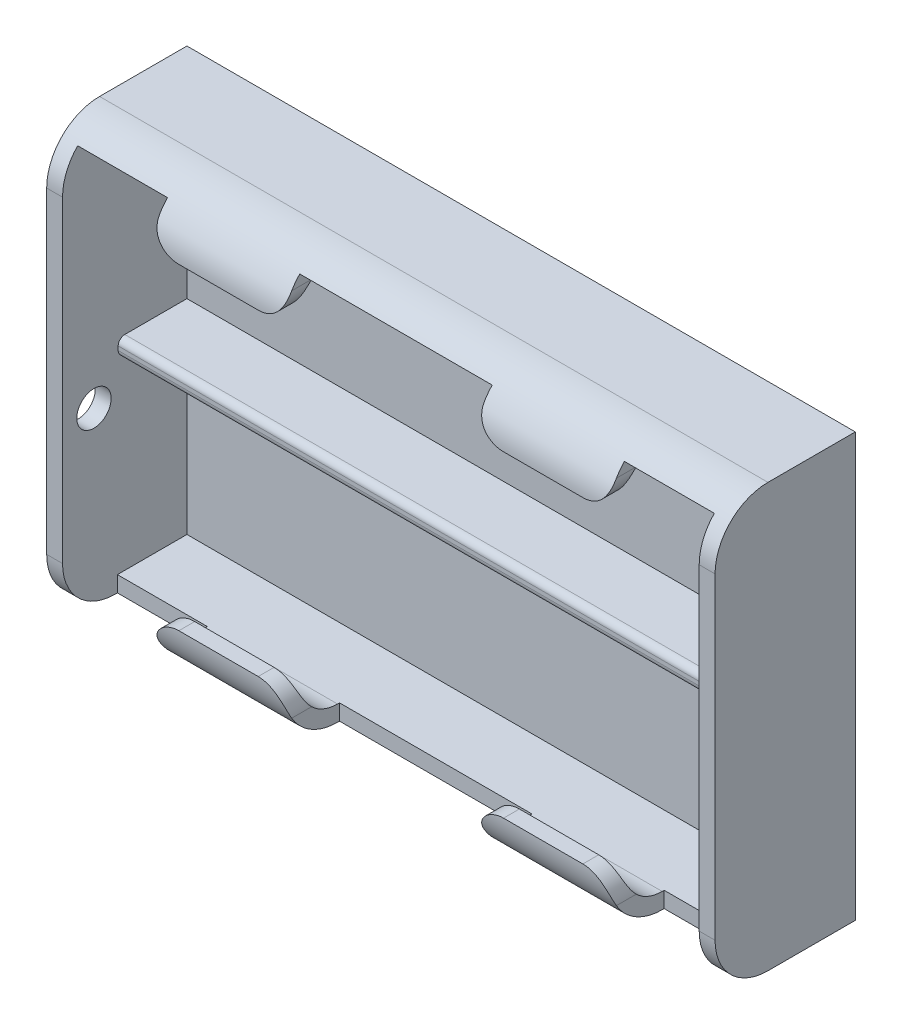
ISO-10303-21;
HEADER;
FILE_DESCRIPTION(('STEP AP214'),'2;1');
FILE_NAME('part.step','',(''),(''),'','','');
FILE_SCHEMA(('AUTOMOTIVE_DESIGN { 1 0 10303 214 1 1 1 1 }'));
ENDSEC;
DATA;
#1=APPLICATION_CONTEXT('core data for automotive mechanical design processes');
#2=APPLICATION_PROTOCOL_DEFINITION('international standard','automotive_design',2000,#1);
#3=PRODUCT_CONTEXT('',#1,'mechanical');
#4=PRODUCT('Part','Part','',(#3));
#5=PRODUCT_RELATED_PRODUCT_CATEGORY('part','',(#4));
#6=PRODUCT_DEFINITION_FORMATION('','',#4);
#7=PRODUCT_DEFINITION_CONTEXT('part definition',#1,'design');
#8=PRODUCT_DEFINITION('design','',#6,#7);
#9=PRODUCT_DEFINITION_SHAPE('','',#8);
#10=(LENGTH_UNIT() NAMED_UNIT(*) SI_UNIT(.MILLI.,.METRE.));
#11=(NAMED_UNIT(*) PLANE_ANGLE_UNIT() SI_UNIT($,.RADIAN.));
#12=(NAMED_UNIT(*) SI_UNIT($,.STERADIAN.) SOLID_ANGLE_UNIT());
#13=UNCERTAINTY_MEASURE_WITH_UNIT(LENGTH_MEASURE(1.E-05),#10,'distance_accuracy_value','');
#14=(GEOMETRIC_REPRESENTATION_CONTEXT(3) GLOBAL_UNCERTAINTY_ASSIGNED_CONTEXT((#13)) GLOBAL_UNIT_ASSIGNED_CONTEXT((#10,
#11,#12)) REPRESENTATION_CONTEXT('',''));
#15=CARTESIAN_POINT('',(0.,0.,0.));
#16=DIRECTION('',(0.,0.,1.));
#17=DIRECTION('',(1.,0.,0.));
#18=AXIS2_PLACEMENT_3D('',#15,#16,#17);
#19=CARTESIAN_POINT('',(0.,4.,-4.));
#20=DIRECTION('',(-1.,0.,0.));
#21=DIRECTION('',(0.,0.,1.));
#22=AXIS2_PLACEMENT_3D('',#19,#20,#21);
#23=CYLINDRICAL_SURFACE('',#22,4.);
#24=CARTESIAN_POINT('',(49.36,4.,-4.));
#25=DIRECTION('',(1.,0.,0.));
#26=DIRECTION('',(0.,1.,0.));
#27=AXIS2_PLACEMENT_3D('',#24,#25,#26);
#28=CIRCLE('',#27,4.);
#29=CARTESIAN_POINT('',(49.36,0.,-4.));
#30=VERTEX_POINT('',#29);
#31=CARTESIAN_POINT('',(49.36,4.,0.));
#32=VERTEX_POINT('',#31);
#33=EDGE_CURVE('E419',#30,#32,#28,.F.);
#34=ORIENTED_EDGE('',*,*,#33,.F.);
#35=DIRECTION('',(1.,0.,0.));
#36=VECTOR('',#35,1.);
#37=CARTESIAN_POINT('',(0.,0.,-4.));
#38=LINE('',#37,#36);
#39=CARTESIAN_POINT('',(50.56,0.,-4.));
#40=VERTEX_POINT('',#39);
#41=EDGE_CURVE('E542',#40,#30,#38,.F.);
#42=ORIENTED_EDGE('',*,*,#41,.F.);
#43=CARTESIAN_POINT('',(50.56,4.,-4.));
#44=DIRECTION('',(1.,0.,0.));
#45=DIRECTION('',(0.,1.,0.));
#46=AXIS2_PLACEMENT_3D('',#43,#44,#45);
#47=CIRCLE('',#46,4.);
#48=CARTESIAN_POINT('',(50.56,4.,0.));
#49=VERTEX_POINT('',#48);
#50=EDGE_CURVE('E537',#49,#40,#47,.T.);
#51=ORIENTED_EDGE('',*,*,#50,.F.);
#52=DIRECTION('',(1.,0.,0.));
#53=VECTOR('',#52,1.);
#54=CARTESIAN_POINT('',(50.56,4.,0.));
#55=LINE('',#54,#53);
#56=EDGE_CURVE('E515',#32,#49,#55,.T.);
#57=ORIENTED_EDGE('',*,*,#56,.F.);
#58=EDGE_LOOP('',(#34,#42,#51,#57));
#59=FACE_BOUND('',#58,.T.);
#60=ADVANCED_FACE('F26',(#59),#23,.T.);
#61=CARTESIAN_POINT('',(42.56,0.,-4.));
#62=VERTEX_POINT('',#61);
#63=CARTESIAN_POINT('',(32.56,0.,-4.));
#64=VERTEX_POINT('',#63);
#65=EDGE_CURVE('E546',#62,#64,#38,.F.);
#66=ORIENTED_EDGE('',*,*,#65,.F.);
#67=CARTESIAN_POINT('',(42.56,4.,-4.));
#68=DIRECTION('',(-1.,0.,0.));
#69=DIRECTION('',(0.,-1.,0.));
#70=AXIS2_PLACEMENT_3D('',#67,#68,#69);
#71=CIRCLE('',#70,4.);
#72=CARTESIAN_POINT('',(42.56,2.,-0.535898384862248));
#73=VERTEX_POINT('',#72);
#74=EDGE_CURVE('E417',#73,#62,#71,.F.);
#75=ORIENTED_EDGE('',*,*,#74,.F.);
#76=CARTESIAN_POINT('',(42.56,2.,-0.535898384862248));
#77=CARTESIAN_POINT('',(42.5600050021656,2.04817066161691,-0.508077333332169));
#78=CARTESIAN_POINT('',(42.5582592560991,2.09694198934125,-0.481268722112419));
#79=CARTESIAN_POINT('',(42.5510457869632,2.1953682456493,-0.429793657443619));
#80=CARTESIAN_POINT('',(42.5455757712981,2.24502370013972,-0.405128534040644));
#81=CARTESIAN_POINT('',(42.530682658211,2.34490785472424,-0.358060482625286));
#82=CARTESIAN_POINT('',(42.5212542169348,2.3951372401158,-0.335660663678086));
#83=CARTESIAN_POINT('',(42.4982981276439,2.49564416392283,-0.293263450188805));
#84=CARTESIAN_POINT('',(42.4847713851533,2.54592168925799,-0.273265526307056));
#85=CARTESIAN_POINT('',(42.4377236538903,2.6965690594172,-0.216808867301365));
#86=CARTESIAN_POINT('',(42.3977802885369,2.79643295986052,-0.184036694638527));
#87=CARTESIAN_POINT('',(42.3009979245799,2.99028092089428,-0.128222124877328));
#88=CARTESIAN_POINT('',(42.2441849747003,3.08427377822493,-0.10516485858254));
#89=CARTESIAN_POINT('',(42.1187417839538,3.2574067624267,-0.0685969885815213));
#90=CARTESIAN_POINT('',(42.0510073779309,3.33709618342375,-0.0546030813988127));
#91=CARTESIAN_POINT('',(41.9034020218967,3.48533598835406,-0.0325381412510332));
#92=CARTESIAN_POINT('',(41.8235234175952,3.55387929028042,-0.024470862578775));
#93=CARTESIAN_POINT('',(41.6524056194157,3.67870503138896,-0.012422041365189));
#94=CARTESIAN_POINT('',(41.5610012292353,3.73476734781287,-0.00850985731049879));
#95=CARTESIAN_POINT('',(41.3703736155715,3.83159230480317,-0.00325153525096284));
#96=CARTESIAN_POINT('',(41.2711502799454,3.87235472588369,-0.00190543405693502));
#97=CARTESIAN_POINT('',(41.0709982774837,3.93636784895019,-0.000381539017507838));
#98=CARTESIAN_POINT('',(40.97025122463,3.96018216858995,-0.000164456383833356));
#99=CARTESIAN_POINT('',(40.8173603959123,3.98404567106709,-2.49546982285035E-05));
#100=CARTESIAN_POINT('',(40.7660792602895,3.99002385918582,-9.50803521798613E-06));
#101=CARTESIAN_POINT('',(40.6632055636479,3.99800107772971,5.45550317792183E-07));
#102=CARTESIAN_POINT('',(40.6116129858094,3.99999989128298,-4.84866291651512E-06));
#103=CARTESIAN_POINT('',(40.56,4.,0.));
#104=B_SPLINE_CURVE_WITH_KNOTS('',3,(#76,#77,#78,#79,#80,#81,#82,#83,#84,#85,#86,#87,#88,#89,
#90,#91,#92,#93,#94,#95,#96,#97,#98,#99,#100,#101,#102,#103),.UNSPECIFIED.,.F.,.F.,(4,2,2,2,2,2,
2,2,2,2,2,2,2,4),(0.,0.166862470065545,0.333827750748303,0.501019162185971,0.668173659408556,
1.00353843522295,1.33838803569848,1.65346616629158,1.96874371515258,2.28920505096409,
2.60967098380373,2.91890658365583,3.07365783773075,3.22841752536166),.UNSPECIFIED.);
#105=CARTESIAN_POINT('',(40.56,4.,0.));
#106=VERTEX_POINT('',#105);
#107=EDGE_CURVE('E766',#73,#106,#104,.T.);
#108=ORIENTED_EDGE('',*,*,#107,.T.);
#109=DIRECTION('',(1.,0.,0.));
#110=VECTOR('',#109,1.);
#111=CARTESIAN_POINT('',(50.56,4.,0.));
#112=LINE('',#111,#110);
#113=CARTESIAN_POINT('',(34.56,4.,0.));
#114=VERTEX_POINT('',#113);
#115=EDGE_CURVE('E441',#114,#106,#112,.T.);
#116=ORIENTED_EDGE('',*,*,#115,.F.);
#117=CARTESIAN_POINT('',(34.56,4.,0.));
#118=CARTESIAN_POINT('',(34.5038863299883,4.0000053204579,-8.75036591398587E-06));
#119=CARTESIAN_POINT('',(34.4477752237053,3.9976384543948,-2.27188128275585E-07));
#120=CARTESIAN_POINT('',(34.3359519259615,3.98820155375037,-1.23040686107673E-05));
#121=CARTESIAN_POINT('',(34.2802397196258,3.98113169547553,-3.29030351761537E-05));
#122=CARTESIAN_POINT('',(34.1696205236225,3.96233286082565,-0.000166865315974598));
#123=CARTESIAN_POINT('',(34.1147132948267,3.95060529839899,-0.000280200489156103));
#124=CARTESIAN_POINT('',(34.0060934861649,3.92258626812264,-0.000724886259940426));
#125=CARTESIAN_POINT('',(33.9523808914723,3.90629485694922,-0.00105623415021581));
#126=CARTESIAN_POINT('',(33.7935378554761,3.85070117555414,-0.00261233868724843));
#127=CARTESIAN_POINT('',(33.6906725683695,3.80467440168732,-0.00439903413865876));
#128=CARTESIAN_POINT('',(33.4942489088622,3.69610709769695,-0.0111923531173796));
#129=CARTESIAN_POINT('',(33.4006890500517,3.63356921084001,-0.0161984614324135));
#130=CARTESIAN_POINT('',(33.2264853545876,3.49466065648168,-0.0314422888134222));
#131=CARTESIAN_POINT('',(33.145718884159,3.41843844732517,-0.0416258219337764));
#132=CARTESIAN_POINT('',(32.9984542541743,3.25447279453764,-0.0692148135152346));
#133=CARTESIAN_POINT('',(32.9319448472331,3.16673852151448,-0.0866145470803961));
#134=CARTESIAN_POINT('',(32.8173428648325,2.98693700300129,-0.129356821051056));
#135=CARTESIAN_POINT('',(32.7686070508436,2.89519484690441,-0.154344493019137));
#136=CARTESIAN_POINT('',(32.6865776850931,2.70765545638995,-0.21324610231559));
#137=CARTESIAN_POINT('',(32.6532998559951,2.61185420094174,-0.247169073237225));
#138=CARTESIAN_POINT('',(32.6043990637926,2.42868099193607,-0.320357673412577));
#139=CARTESIAN_POINT('',(32.5874259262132,2.34135051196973,-0.358836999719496));
#140=CARTESIAN_POINT('',(32.5707778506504,2.21187549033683,-0.421603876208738));
#141=CARTESIAN_POINT('',(32.5666968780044,2.16900014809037,-0.443350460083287));
#142=CARTESIAN_POINT('',(32.5613084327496,2.08393937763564,-0.488443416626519));
#143=CARTESIAN_POINT('',(32.5599999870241,2.04175371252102,-0.51178922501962));
#144=CARTESIAN_POINT('',(32.56,1.99999999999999,-0.535898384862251));
#145=B_SPLINE_CURVE_WITH_KNOTS('',3,(#117,#118,#119,#120,#121,#122,#123,#124,#125,#126,#127,
#128,#129,#130,#131,#132,#133,#134,#135,#136,#137,#138,#139,#140,#141,#142,#143,#144),
.UNSPECIFIED.,.F.,.F.,(4,2,2,2,2,2,2,2,2,2,2,2,2,4),(0.,0.168286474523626,0.336566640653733,
0.504795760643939,0.673022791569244,1.00938791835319,1.34569922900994,1.67856108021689,
2.01115936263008,2.33012237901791,2.64940911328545,2.93911090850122,3.08375898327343,
3.22835628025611),.UNSPECIFIED.);
#146=CARTESIAN_POINT('',(32.56,1.99999999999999,-0.53589838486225));
#147=VERTEX_POINT('',#146);
#148=EDGE_CURVE('E750',#114,#147,#145,.T.);
#149=ORIENTED_EDGE('',*,*,#148,.T.);
#150=CARTESIAN_POINT('',(32.56,4.,-4.));
#151=DIRECTION('',(1.,0.,0.));
#152=DIRECTION('',(0.,1.,0.));
#153=AXIS2_PLACEMENT_3D('',#150,#151,#152);
#154=CIRCLE('',#153,4.);
#155=EDGE_CURVE('E414',#64,#147,#154,.F.);
#156=ORIENTED_EDGE('',*,*,#155,.F.);
#157=EDGE_LOOP('',(#66,#75,#108,#116,#149,#156));
#158=FACE_BOUND('',#157,.T.);
#159=ADVANCED_FACE('F788',(#158),#23,.T.);
#160=CARTESIAN_POINT('',(1.19999999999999,0.,-4.));
#161=VERTEX_POINT('',#160);
#162=CARTESIAN_POINT('',(0.,0.,-4.));
#163=VERTEX_POINT('',#162);
#164=EDGE_CURVE('E541',#161,#163,#38,.F.);
#165=ORIENTED_EDGE('',*,*,#164,.F.);
#166=CARTESIAN_POINT('',(1.2,4.,-4.));
#167=DIRECTION('',(-1.,0.,0.));
#168=DIRECTION('',(0.,-1.,0.));
#169=AXIS2_PLACEMENT_3D('',#166,#167,#168);
#170=CIRCLE('',#169,4.);
#171=CARTESIAN_POINT('',(1.2,4.,0.));
#172=VERTEX_POINT('',#171);
#173=EDGE_CURVE('E398',#172,#161,#170,.F.);
#174=ORIENTED_EDGE('',*,*,#173,.F.);
#175=CARTESIAN_POINT('',(0.,4.,0.));
#176=VERTEX_POINT('',#175);
#177=EDGE_CURVE('E524',#176,#172,#55,.T.);
#178=ORIENTED_EDGE('',*,*,#177,.F.);
#179=CARTESIAN_POINT('',(0.,4.,-4.));
#180=DIRECTION('',(-1.,0.,0.));
#181=DIRECTION('',(0.,0.,1.));
#182=AXIS2_PLACEMENT_3D('',#179,#180,#181);
#183=CIRCLE('',#182,4.);
#184=EDGE_CURVE('E531',#163,#176,#183,.T.);
#185=ORIENTED_EDGE('',*,*,#184,.F.);
#186=EDGE_LOOP('',(#165,#174,#178,#185));
#187=FACE_BOUND('',#186,.T.);
#188=ADVANCED_FACE('F761',(#187),#23,.T.);
#189=CARTESIAN_POINT('',(1.2,0.,-10.61));
#190=DIRECTION('',(-1.,0.,0.));
#191=DIRECTION('',(0.,0.,1.));
#192=AXIS2_PLACEMENT_3D('',#189,#190,#191);
#193=PLANE('',#192);
#194=CARTESIAN_POINT('',(1.2,12.9800772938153,-2.37636219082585));
#195=DIRECTION('',(-1.,0.,0.));
#196=DIRECTION('',(0.,0.,1.));
#197=AXIS2_PLACEMENT_3D('',#194,#195,#196);
#198=CIRCLE('',#197,1.3);
#199=CARTESIAN_POINT('',(1.2,12.9800772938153,-1.07636219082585));
#200=VERTEX_POINT('',#199);
#201=EDGE_CURVE('E931',#200,#200,#198,.T.);
#202=ORIENTED_EDGE('',*,*,#201,.T.);
#203=EDGE_LOOP('',(#202));
#204=FACE_BOUND('',#203,.T.);
#205=DIRECTION('',(0.,-1.,0.));
#206=VECTOR('',#205,1.);
#207=CARTESIAN_POINT('',(1.2,0.,0.));
#208=LINE('',#207,#206);
#209=CARTESIAN_POINT('',(1.20000000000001,28.,0.));
#210=VERTEX_POINT('',#209);
#211=EDGE_CURVE('E440',#210,#172,#208,.T.);
#212=ORIENTED_EDGE('',*,*,#211,.T.);
#213=ORIENTED_EDGE('',*,*,#173,.T.);
#214=DIRECTION('',(0.,0.,-1.));
#215=VECTOR('',#214,1.);
#216=CARTESIAN_POINT('',(1.19999999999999,0.,-10.61));
#217=LINE('',#216,#215);
#218=CARTESIAN_POINT('',(1.19999999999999,0.,-4.15));
#219=VERTEX_POINT('',#218);
#220=EDGE_CURVE('E379',#161,#219,#217,.T.);
#221=ORIENTED_EDGE('',*,*,#220,.T.);
#222=DIRECTION('',(0.,-1.,0.));
#223=VECTOR('',#222,1.);
#224=CARTESIAN_POINT('',(1.19999999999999,-1.64045460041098,-4.15));
#225=LINE('',#224,#223);
#226=CARTESIAN_POINT('',(1.19999999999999,1.2,-4.15));
#227=VERTEX_POINT('',#226);
#228=EDGE_CURVE('E334',#227,#219,#225,.T.);
#229=ORIENTED_EDGE('',*,*,#228,.F.);
#230=DIRECTION('',(0.,0.,1.));
#231=VECTOR('',#230,1.);
#232=CARTESIAN_POINT('',(1.2,1.2,-10.61));
#233=LINE('',#232,#231);
#234=CARTESIAN_POINT('',(1.2,1.2,-9.41));
#235=VERTEX_POINT('',#234);
#236=EDGE_CURVE('E457',#235,#227,#233,.T.);
#237=ORIENTED_EDGE('',*,*,#236,.F.);
#238=DIRECTION('',(0.,-1.,0.));
#239=VECTOR('',#238,1.);
#240=CARTESIAN_POINT('',(1.2,0.,-9.41));
#241=LINE('',#240,#239);
#242=CARTESIAN_POINT('',(1.2,15.35,-9.41));
#243=VERTEX_POINT('',#242);
#244=EDGE_CURVE('E456',#243,#235,#241,.T.);
#245=ORIENTED_EDGE('',*,*,#244,.F.);
#246=DIRECTION('',(0.,0.,-1.));
#247=VECTOR('',#246,1.);
#248=CARTESIAN_POINT('',(1.2,15.35,-10.61));
#249=LINE('',#248,#247);
#250=CARTESIAN_POINT('',(1.2,15.35,-4.71));
#251=VERTEX_POINT('',#250);
#252=EDGE_CURVE('E389',#251,#243,#249,.T.);
#253=ORIENTED_EDGE('',*,*,#252,.F.);
#254=CARTESIAN_POINT('',(1.2,15.85,-4.71));
#255=DIRECTION('',(-1.,0.,0.));
#256=DIRECTION('',(0.,0.,1.));
#257=AXIS2_PLACEMENT_3D('',#254,#255,#256);
#258=CIRCLE('',#257,0.5);
#259=CARTESIAN_POINT('',(1.2,15.85,-4.21));
#260=VERTEX_POINT('',#259);
#261=EDGE_CURVE('E589',#251,#260,#258,.T.);
#262=ORIENTED_EDGE('',*,*,#261,.T.);
#263=DIRECTION('',(0.,1.,0.));
#264=VECTOR('',#263,1.);
#265=CARTESIAN_POINT('',(1.2,0.,-4.21));
#266=LINE('',#265,#264);
#267=CARTESIAN_POINT('',(1.2,16.15,-4.21));
#268=VERTEX_POINT('',#267);
#269=EDGE_CURVE('E391',#260,#268,#266,.T.);
#270=ORIENTED_EDGE('',*,*,#269,.T.);
#271=CARTESIAN_POINT('',(1.2,16.15,-4.71));
#272=DIRECTION('',(-1.,0.,0.));
#273=DIRECTION('',(0.,0.,1.));
#274=AXIS2_PLACEMENT_3D('',#271,#272,#273);
#275=CIRCLE('',#274,0.5);
#276=CARTESIAN_POINT('',(1.2,16.65,-4.71));
#277=VERTEX_POINT('',#276);
#278=EDGE_CURVE('E591',#268,#277,#275,.T.);
#279=ORIENTED_EDGE('',*,*,#278,.T.);
#280=DIRECTION('',(0.,0.,1.));
#281=VECTOR('',#280,1.);
#282=CARTESIAN_POINT('',(1.2,16.65,-10.61));
#283=LINE('',#282,#281);
#284=CARTESIAN_POINT('',(1.2,16.65,-9.41));
#285=VERTEX_POINT('',#284);
#286=EDGE_CURVE('E383',#285,#277,#283,.T.);
#287=ORIENTED_EDGE('',*,*,#286,.F.);
#288=CARTESIAN_POINT('',(1.2,30.8,-9.41));
#289=VERTEX_POINT('',#288);
#290=EDGE_CURVE('E453',#289,#285,#241,.T.);
#291=ORIENTED_EDGE('',*,*,#290,.F.);
#292=DIRECTION('',(0.,0.,1.));
#293=VECTOR('',#292,1.);
#294=CARTESIAN_POINT('',(1.2,30.8,-10.61));
#295=LINE('',#294,#293);
#296=CARTESIAN_POINT('',(1.20000000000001,30.8,-1.14342862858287));
#297=VERTEX_POINT('',#296);
#298=EDGE_CURVE('E445',#289,#297,#295,.T.);
#299=ORIENTED_EDGE('',*,*,#298,.T.);
#300=CARTESIAN_POINT('',(1.20000000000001,28.,-4.));
#301=DIRECTION('',(-1.,0.,0.));
#302=DIRECTION('',(0.,-1.,0.));
#303=AXIS2_PLACEMENT_3D('',#300,#301,#302);
#304=CIRCLE('',#303,4.);
#305=EDGE_CURVE('E408',#297,#210,#304,.F.);
#306=ORIENTED_EDGE('',*,*,#305,.T.);
#307=EDGE_LOOP('',(#212,#213,#221,#229,#237,#245,#253,#262,#270,#279,#287,#291,#299,#306));
#308=FACE_BOUND('',#307,.T.);
#309=ADVANCED_FACE('F913',(#204,#308),#193,.F.);
#310=CARTESIAN_POINT('',(49.36,0.,-10.61));
#311=DIRECTION('',(1.,0.,0.));
#312=DIRECTION('',(0.,1.,0.));
#313=AXIS2_PLACEMENT_3D('',#310,#311,#312);
#314=PLANE('',#313);
#315=CARTESIAN_POINT('',(49.36,28.,-4.));
#316=DIRECTION('',(1.,0.,0.));
#317=DIRECTION('',(0.,1.,0.));
#318=AXIS2_PLACEMENT_3D('',#315,#316,#317);
#319=CIRCLE('',#318,4.);
#320=CARTESIAN_POINT('',(49.36,28.,0.));
#321=VERTEX_POINT('',#320);
#322=CARTESIAN_POINT('',(49.36,30.8,-1.14342862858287));
#323=VERTEX_POINT('',#322);
#324=EDGE_CURVE('E421',#321,#323,#319,.F.);
#325=ORIENTED_EDGE('',*,*,#324,.T.);
#326=DIRECTION('',(0.,0.,1.));
#327=VECTOR('',#326,1.);
#328=CARTESIAN_POINT('',(49.36,30.8,-10.61));
#329=LINE('',#328,#327);
#330=CARTESIAN_POINT('',(49.36,30.8,-9.41));
#331=VERTEX_POINT('',#330);
#332=EDGE_CURVE('E452',#331,#323,#329,.T.);
#333=ORIENTED_EDGE('',*,*,#332,.F.);
#334=DIRECTION('',(0.,1.,0.));
#335=VECTOR('',#334,1.);
#336=CARTESIAN_POINT('',(49.36,0.,-9.41));
#337=LINE('',#336,#335);
#338=CARTESIAN_POINT('',(49.36,16.65,-9.41));
#339=VERTEX_POINT('',#338);
#340=EDGE_CURVE('E474',#339,#331,#337,.T.);
#341=ORIENTED_EDGE('',*,*,#340,.F.);
#342=DIRECTION('',(0.,0.,-1.));
#343=VECTOR('',#342,1.);
#344=CARTESIAN_POINT('',(49.36,16.65,-10.61));
#345=LINE('',#344,#343);
#346=CARTESIAN_POINT('',(49.36,16.65,-4.71));
#347=VERTEX_POINT('',#346);
#348=EDGE_CURVE('E381',#347,#339,#345,.T.);
#349=ORIENTED_EDGE('',*,*,#348,.F.);
#350=CARTESIAN_POINT('',(49.36,16.15,-4.71));
#351=DIRECTION('',(1.,0.,0.));
#352=DIRECTION('',(0.,1.,0.));
#353=AXIS2_PLACEMENT_3D('',#350,#351,#352);
#354=CIRCLE('',#353,0.5);
#355=CARTESIAN_POINT('',(49.36,16.15,-4.21));
#356=VERTEX_POINT('',#355);
#357=EDGE_CURVE('E593',#347,#356,#354,.T.);
#358=ORIENTED_EDGE('',*,*,#357,.T.);
#359=DIRECTION('',(0.,-1.,0.));
#360=VECTOR('',#359,1.);
#361=CARTESIAN_POINT('',(49.36,0.,-4.21));
#362=LINE('',#361,#360);
#363=CARTESIAN_POINT('',(49.36,15.85,-4.21));
#364=VERTEX_POINT('',#363);
#365=EDGE_CURVE('E574',#356,#364,#362,.T.);
#366=ORIENTED_EDGE('',*,*,#365,.T.);
#367=CARTESIAN_POINT('',(49.36,15.85,-4.71));
#368=DIRECTION('',(1.,0.,0.));
#369=DIRECTION('',(0.,1.,0.));
#370=AXIS2_PLACEMENT_3D('',#367,#368,#369);
#371=CIRCLE('',#370,0.5);
#372=CARTESIAN_POINT('',(49.36,15.35,-4.71));
#373=VERTEX_POINT('',#372);
#374=EDGE_CURVE('E587',#364,#373,#371,.T.);
#375=ORIENTED_EDGE('',*,*,#374,.T.);
#376=DIRECTION('',(0.,0.,1.));
#377=VECTOR('',#376,1.);
#378=CARTESIAN_POINT('',(49.36,15.35,-10.61));
#379=LINE('',#378,#377);
#380=CARTESIAN_POINT('',(49.36,15.35,-9.41));
#381=VERTEX_POINT('',#380);
#382=EDGE_CURVE('E386',#381,#373,#379,.T.);
#383=ORIENTED_EDGE('',*,*,#382,.F.);
#384=CARTESIAN_POINT('',(49.36,1.2,-9.41));
#385=VERTEX_POINT('',#384);
#386=EDGE_CURVE('E469',#385,#381,#337,.T.);
#387=ORIENTED_EDGE('',*,*,#386,.F.);
#388=DIRECTION('',(0.,0.,1.));
#389=VECTOR('',#388,1.);
#390=CARTESIAN_POINT('',(49.36,1.2,-10.61));
#391=LINE('',#390,#389);
#392=CARTESIAN_POINT('',(49.36,1.2,-4.15));
#393=VERTEX_POINT('',#392);
#394=EDGE_CURVE('E460',#385,#393,#391,.T.);
#395=ORIENTED_EDGE('',*,*,#394,.T.);
#396=DIRECTION('',(0.,1.,0.));
#397=VECTOR('',#396,1.);
#398=CARTESIAN_POINT('',(49.36,28.4962640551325,-4.15));
#399=LINE('',#398,#397);
#400=CARTESIAN_POINT('',(49.36,0.,-4.15));
#401=VERTEX_POINT('',#400);
#402=EDGE_CURVE('E356',#401,#393,#399,.T.);
#403=ORIENTED_EDGE('',*,*,#402,.F.);
#404=DIRECTION('',(0.,0.,1.));
#405=VECTOR('',#404,1.);
#406=CARTESIAN_POINT('',(49.36,0.,-10.61));
#407=LINE('',#406,#405);
#408=EDGE_CURVE('E338',#401,#30,#407,.T.);
#409=ORIENTED_EDGE('',*,*,#408,.T.);
#410=ORIENTED_EDGE('',*,*,#33,.T.);
#411=DIRECTION('',(0.,1.,0.));
#412=VECTOR('',#411,1.);
#413=CARTESIAN_POINT('',(49.36,0.,0.));
#414=LINE('',#413,#412);
#415=EDGE_CURVE('E482',#32,#321,#414,.T.);
#416=ORIENTED_EDGE('',*,*,#415,.T.);
#417=EDGE_LOOP('',(#325,#333,#341,#349,#358,#366,#375,#383,#387,#395,#403,#409,#410,#416));
#418=FACE_BOUND('',#417,.T.);
#419=ADVANCED_FACE('F801',(#418),#314,.F.);
#420=CARTESIAN_POINT('',(0.,32.,-9.41));
#421=DIRECTION('',(0.,0.,-1.));
#422=DIRECTION('',(-1.,0.,0.));
#423=AXIS2_PLACEMENT_3D('',#420,#421,#422);
#424=PLANE('',#423);
#425=DIRECTION('',(1.,0.,0.));
#426=VECTOR('',#425,1.);
#427=CARTESIAN_POINT('',(0.,15.35,-9.41));
#428=LINE('',#427,#426);
#429=EDGE_CURVE('E571',#243,#381,#428,.T.);
#430=ORIENTED_EDGE('',*,*,#429,.F.);
#431=ORIENTED_EDGE('',*,*,#244,.T.);
#432=DIRECTION('',(1.,0.,0.));
#433=VECTOR('',#432,1.);
#434=CARTESIAN_POINT('',(0.,1.2,-9.41));
#435=LINE('',#434,#433);
#436=EDGE_CURVE('E455',#235,#385,#435,.T.);
#437=ORIENTED_EDGE('',*,*,#436,.T.);
#438=ORIENTED_EDGE('',*,*,#386,.T.);
#439=EDGE_LOOP('',(#430,#431,#437,#438));
#440=FACE_BOUND('',#439,.T.);
#441=ADVANCED_FACE('F654',(#440),#424,.F.);
#442=DIRECTION('',(-1.,0.,0.));
#443=VECTOR('',#442,1.);
#444=CARTESIAN_POINT('',(0.,16.65,-9.41));
#445=LINE('',#444,#443);
#446=EDGE_CURVE('E568',#339,#285,#445,.T.);
#447=ORIENTED_EDGE('',*,*,#446,.F.);
#448=ORIENTED_EDGE('',*,*,#340,.T.);
#449=DIRECTION('',(-1.,0.,0.));
#450=VECTOR('',#449,1.);
#451=CARTESIAN_POINT('',(0.,30.8,-9.41));
#452=LINE('',#451,#450);
#453=EDGE_CURVE('E461',#331,#289,#452,.T.);
#454=ORIENTED_EDGE('',*,*,#453,.T.);
#455=ORIENTED_EDGE('',*,*,#290,.T.);
#456=EDGE_LOOP('',(#447,#448,#454,#455));
#457=FACE_BOUND('',#456,.T.);
#458=ADVANCED_FACE('F1089',(#457),#424,.F.);
#459=CARTESIAN_POINT('',(50.56,4.,0.));
#460=DIRECTION('',(0.,1.,0.));
#461=DIRECTION('',(1.,0.,0.));
#462=AXIS2_PLACEMENT_3D('',#459,#460,#461);
#463=PLANE('',#462);
#464=ORIENTED_EDGE('',*,*,#115,.T.);
#465=DIRECTION('',(0.,0.,-1.));
#466=VECTOR('',#465,1.);
#467=CARTESIAN_POINT('',(40.56,4.,0.));
#468=LINE('',#467,#466);
#469=CARTESIAN_POINT('',(40.56,4.,-1.2));
#470=VERTEX_POINT('',#469);
#471=EDGE_CURVE('E852',#106,#470,#468,.T.);
#472=ORIENTED_EDGE('',*,*,#471,.T.);
#473=DIRECTION('',(-1.,0.,0.));
#474=VECTOR('',#473,1.);
#475=CARTESIAN_POINT('',(25.28,4.,-1.2));
#476=LINE('',#475,#474);
#477=CARTESIAN_POINT('',(34.56,4.,-1.2));
#478=VERTEX_POINT('',#477);
#479=EDGE_CURVE('E483',#478,#470,#476,.F.);
#480=ORIENTED_EDGE('',*,*,#479,.F.);
#481=DIRECTION('',(0.,0.,1.));
#482=VECTOR('',#481,1.);
#483=CARTESIAN_POINT('',(34.56,4.,0.));
#484=LINE('',#483,#482);
#485=EDGE_CURVE('E847',#478,#114,#484,.T.);
#486=ORIENTED_EDGE('',*,*,#485,.T.);
#487=EDGE_LOOP('',(#464,#472,#480,#486));
#488=FACE_BOUND('',#487,.T.);
#489=ADVANCED_FACE('F1082',(#488),#463,.T.);
#490=CARTESIAN_POINT('',(0.,28.,0.));
#491=DIRECTION('',(0.,-1.,0.));
#492=DIRECTION('',(-1.,0.,0.));
#493=AXIS2_PLACEMENT_3D('',#490,#491,#492);
#494=PLANE('',#493);
#495=DIRECTION('',(1.,0.,0.));
#496=VECTOR('',#495,1.);
#497=CARTESIAN_POINT('',(25.28,28.,-1.2));
#498=LINE('',#497,#496);
#499=CARTESIAN_POINT('',(16.,28.,-1.2));
#500=VERTEX_POINT('',#499);
#501=CARTESIAN_POINT('',(10.,28.,-1.2));
#502=VERTEX_POINT('',#501);
#503=EDGE_CURVE('E492',#500,#502,#498,.F.);
#504=ORIENTED_EDGE('',*,*,#503,.F.);
#505=DIRECTION('',(0.,0.,1.));
#506=VECTOR('',#505,1.);
#507=CARTESIAN_POINT('',(16.,28.,0.));
#508=LINE('',#507,#506);
#509=CARTESIAN_POINT('',(16.,28.,0.));
#510=VERTEX_POINT('',#509);
#511=EDGE_CURVE('E598',#500,#510,#508,.T.);
#512=ORIENTED_EDGE('',*,*,#511,.T.);
#513=DIRECTION('',(-1.,0.,0.));
#514=VECTOR('',#513,1.);
#515=CARTESIAN_POINT('',(0.,28.,0.));
#516=LINE('',#515,#514);
#517=CARTESIAN_POINT('',(10.,28.,0.));
#518=VERTEX_POINT('',#517);
#519=EDGE_CURVE('E450',#510,#518,#516,.T.);
#520=ORIENTED_EDGE('',*,*,#519,.T.);
#521=DIRECTION('',(0.,0.,-1.));
#522=VECTOR('',#521,1.);
#523=CARTESIAN_POINT('',(10.,28.,0.));
#524=LINE('',#523,#522);
#525=EDGE_CURVE('E595',#518,#502,#524,.T.);
#526=ORIENTED_EDGE('',*,*,#525,.T.);
#527=EDGE_LOOP('',(#504,#512,#520,#526));
#528=FACE_BOUND('',#527,.T.);
#529=ADVANCED_FACE('F920',(#528),#494,.T.);
#530=CARTESIAN_POINT('',(0.,28.,-4.));
#531=DIRECTION('',(1.,0.,0.));
#532=DIRECTION('',(0.,0.,-1.));
#533=AXIS2_PLACEMENT_3D('',#530,#531,#532);
#534=CYLINDRICAL_SURFACE('',#533,2.8);
#535=CARTESIAN_POINT('',(18.,28.,-4.));
#536=DIRECTION('',(-1.,0.,0.));
#537=DIRECTION('',(0.,0.,1.));
#538=AXIS2_PLACEMENT_3D('',#535,#536,#537);
#539=CIRCLE('',#538,2.8);
#540=CARTESIAN_POINT('',(18.,30.8,-4.));
#541=VERTEX_POINT('',#540);
#542=CARTESIAN_POINT('',(18.,30.,-2.04040820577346));
#543=VERTEX_POINT('',#542);
#544=EDGE_CURVE('E563',#541,#543,#539,.F.);
#545=ORIENTED_EDGE('',*,*,#544,.T.);
#546=CARTESIAN_POINT('',(18.,30.,-2.04040820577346));
#547=CARTESIAN_POINT('',(18.0000012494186,29.9614461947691,-2.0010482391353));
#548=CARTESIAN_POINT('',(17.9988846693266,29.9217077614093,-1.96282525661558));
#549=CARTESIAN_POINT('',(17.9940172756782,29.8401030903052,-1.8888281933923));
#550=CARTESIAN_POINT('',(17.9902640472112,29.7982349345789,-1.85305639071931));
#551=CARTESIAN_POINT('',(17.9797017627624,29.7125090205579,-1.78406876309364));
#552=CARTESIAN_POINT('',(17.9728802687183,29.6686438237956,-1.75086399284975));
#553=CARTESIAN_POINT('',(17.9558254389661,29.5795108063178,-1.68739385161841));
#554=CARTESIAN_POINT('',(17.9455931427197,29.5342434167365,-1.65712758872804));
#555=CARTESIAN_POINT('',(17.9091092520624,29.3964003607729,-1.57063543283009));
#556=CARTESIAN_POINT('',(17.8771197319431,29.3022547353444,-1.51909213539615));
#557=CARTESIAN_POINT('',(17.7964597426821,29.1150848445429,-1.42952495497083));
#558=CARTESIAN_POINT('',(17.7478408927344,29.0220580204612,-1.39145996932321));
#559=CARTESIAN_POINT('',(17.6400632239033,28.8513896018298,-1.33120296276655));
#560=CARTESIAN_POINT('',(17.5825261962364,28.7731540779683,-1.3077719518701));
#561=CARTESIAN_POINT('',(17.455379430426,28.6247065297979,-1.26949942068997));
#562=CARTESIAN_POINT('',(17.3857572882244,28.5545028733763,-1.25466679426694));
#563=CARTESIAN_POINT('',(17.2361001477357,28.4245926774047,-1.23158928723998));
#564=CARTESIAN_POINT('',(17.1560391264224,28.364913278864,-1.22336125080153));
#565=CARTESIAN_POINT('',(16.9876713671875,28.2580310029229,-1.21139478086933));
#566=CARTESIAN_POINT('',(16.8993616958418,28.2108325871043,-1.20765795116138));
#567=CARTESIAN_POINT('',(16.7093646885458,28.1269190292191,-1.20253563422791));
#568=CARTESIAN_POINT('',(16.6071719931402,28.0913363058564,-1.20136080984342));
#569=CARTESIAN_POINT('',(16.3984594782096,28.037138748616,-1.20011312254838));
#570=CARTESIAN_POINT('',(16.2919455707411,28.0185014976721,-1.20003880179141));
#571=CARTESIAN_POINT('',(16.1540266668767,28.0056996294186,-1.20000568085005));
#572=CARTESIAN_POINT('',(16.123234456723,28.0035610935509,-1.2000022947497));
#573=CARTESIAN_POINT('',(16.0616317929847,28.0007131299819,-1.1999993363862));
#574=CARTESIAN_POINT('',(16.0308214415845,28.0000014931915,-1.19999975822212));
#575=CARTESIAN_POINT('',(16.,28.,-1.2));
#576=B_SPLINE_CURVE_WITH_KNOTS('',3,(#546,#547,#548,#549,#550,#551,#552,#553,#554,#555,#556,
#557,#558,#559,#560,#561,#562,#563,#564,#565,#566,#567,#568,#569,#570,#571,#572,#573,#574,#575),
.UNSPECIFIED.,.F.,.F.,(4,2,2,2,2,2,2,2,2,2,2,2,2,2,4),(0.,0.16527758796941,0.330706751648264,
0.496812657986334,0.662867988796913,0.996767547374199,1.32963991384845,1.62789721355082,
1.9264624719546,2.22578678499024,2.5252179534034,2.84846542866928,3.17128465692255,
3.26386202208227,3.35629595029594),.UNSPECIFIED.);
#577=EDGE_CURVE('E668',#543,#500,#576,.T.);
#578=ORIENTED_EDGE('',*,*,#577,.T.);
#579=ORIENTED_EDGE('',*,*,#503,.T.);
#580=CARTESIAN_POINT('',(10.,28.,-1.2));
#581=CARTESIAN_POINT('',(9.94404108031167,27.9999947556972,-1.20001235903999));
#582=CARTESIAN_POINT('',(9.8880847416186,28.0023485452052,-1.20000031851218));
#583=CARTESIAN_POINT('',(9.77656708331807,28.0117335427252,-1.20001738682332));
#584=CARTESIAN_POINT('',(9.72100575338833,28.0187646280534,-1.20004649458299));
#585=CARTESIAN_POINT('',(9.61063672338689,28.0374683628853,-1.2002358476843));
#586=CARTESIAN_POINT('',(9.55582942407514,28.0491433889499,-1.20039616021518));
#587=CARTESIAN_POINT('',(9.44740297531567,28.0770401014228,-1.20102565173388));
#588=CARTESIAN_POINT('',(9.39378381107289,28.0932617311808,-1.20149482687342));
#589=CARTESIAN_POINT('',(9.23519316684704,28.1486265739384,-1.20369905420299));
#590=CARTESIAN_POINT('',(9.13247645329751,28.1944717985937,-1.20623073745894));
#591=CARTESIAN_POINT('',(8.93640086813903,28.3025630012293,-1.21587033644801));
#592=CARTESIAN_POINT('',(8.8430371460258,28.3648004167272,-1.22297586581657));
#593=CARTESIAN_POINT('',(8.67029846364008,28.5020691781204,-1.24452562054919));
#594=CARTESIAN_POINT('',(8.59067341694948,28.5768082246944,-1.25881449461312));
#595=CARTESIAN_POINT('',(8.44569281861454,28.7367675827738,-1.29742589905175));
#596=CARTESIAN_POINT('',(8.3803259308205,28.821979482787,-1.321740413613));
#597=CARTESIAN_POINT('',(8.27001727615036,28.9917304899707,-1.38009862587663));
#598=CARTESIAN_POINT('',(8.22388307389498,29.0758073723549,-1.41323951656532));
#599=CARTESIAN_POINT('',(8.14547280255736,29.2453766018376,-1.49047703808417));
#600=CARTESIAN_POINT('',(8.11319824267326,29.3308691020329,-1.53457486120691));
#601=CARTESIAN_POINT('',(8.06228393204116,29.4973512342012,-1.63208517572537));
#602=CARTESIAN_POINT('',(8.04331503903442,29.57840012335,-1.68522911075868));
#603=CARTESIAN_POINT('',(8.01595227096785,29.7355781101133,-1.8006211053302));
#604=CARTESIAN_POINT('',(8.00755406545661,29.8117092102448,-1.86286542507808));
#605=CARTESIAN_POINT('',(8.00219690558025,29.9041976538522,-1.94701337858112));
#606=CARTESIAN_POINT('',(8.00136068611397,29.9237483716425,-1.96532248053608));
#607=CARTESIAN_POINT('',(8.00026310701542,29.9622879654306,-2.00246700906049));
#608=CARTESIAN_POINT('',(8.00000065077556,29.9812778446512,-2.02130136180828));
#609=CARTESIAN_POINT('',(8.00000000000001,30.,-2.04040820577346));
#610=B_SPLINE_CURVE_WITH_KNOTS('',3,(#580,#581,#582,#583,#584,#585,#586,#587,#588,#589,#590,
#591,#592,#593,#594,#595,#596,#597,#598,#599,#600,#601,#602,#603,#604,#605,#606,#607,#608,#609),
.UNSPECIFIED.,.F.,.F.,(4,2,2,2,2,2,2,2,2,2,2,2,2,2,4),(0.,0.167822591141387,0.3356407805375,
0.503544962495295,0.671447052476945,1.00721492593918,1.34280775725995,1.67143642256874,
1.99980284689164,2.30265384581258,2.60553781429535,2.90063653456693,3.19561432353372,
3.27600055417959,3.35623301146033),.UNSPECIFIED.);
#611=CARTESIAN_POINT('',(8.00000000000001,30.,-2.04040820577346));
#612=VERTEX_POINT('',#611);
#613=EDGE_CURVE('E660',#502,#612,#610,.T.);
#614=ORIENTED_EDGE('',*,*,#613,.T.);
#615=CARTESIAN_POINT('',(8.,28.,-4.));
#616=DIRECTION('',(1.,0.,0.));
#617=DIRECTION('',(0.,1.,0.));
#618=AXIS2_PLACEMENT_3D('',#615,#616,#617);
#619=CIRCLE('',#618,2.8);
#620=CARTESIAN_POINT('',(8.00000000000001,30.8,-4.));
#621=VERTEX_POINT('',#620);
#622=EDGE_CURVE('E566',#612,#621,#619,.F.);
#623=ORIENTED_EDGE('',*,*,#622,.T.);
#624=DIRECTION('',(1.,0.,0.));
#625=VECTOR('',#624,1.);
#626=CARTESIAN_POINT('',(0.,30.8,-4.));
#627=LINE('',#626,#625);
#628=EDGE_CURVE('E464',#621,#541,#627,.T.);
#629=ORIENTED_EDGE('',*,*,#628,.T.);
#630=EDGE_LOOP('',(#545,#578,#579,#614,#623,#629));
#631=FACE_BOUND('',#630,.T.);
#632=ADVANCED_FACE('F653',(#631),#534,.F.);
#633=CARTESIAN_POINT('',(0.,4.,-4.));
#634=DIRECTION('',(-1.,0.,0.));
#635=DIRECTION('',(0.,0.,1.));
#636=AXIS2_PLACEMENT_3D('',#633,#634,#635);
#637=CYLINDRICAL_SURFACE('',#636,2.8);
#638=ORIENTED_EDGE('',*,*,#479,.T.);
#639=CARTESIAN_POINT('',(40.56,4.,-1.2));
#640=CARTESIAN_POINT('',(40.6159589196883,4.00000524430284,-1.20001235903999));
#641=CARTESIAN_POINT('',(40.6719152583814,3.99765145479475,-1.20000031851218));
#642=CARTESIAN_POINT('',(40.7834329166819,3.98826645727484,-1.20001738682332));
#643=CARTESIAN_POINT('',(40.8389942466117,3.9812353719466,-1.20004649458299));
#644=CARTESIAN_POINT('',(40.9493632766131,3.96253163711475,-1.2002358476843));
#645=CARTESIAN_POINT('',(41.0041705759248,3.95085661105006,-1.20039616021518));
#646=CARTESIAN_POINT('',(41.1125970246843,3.92295989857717,-1.20102565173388));
#647=CARTESIAN_POINT('',(41.1662161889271,3.90673826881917,-1.20149482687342));
#648=CARTESIAN_POINT('',(41.324806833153,3.85137342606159,-1.20369905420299));
#649=CARTESIAN_POINT('',(41.4275235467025,3.80552820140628,-1.20623073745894));
#650=CARTESIAN_POINT('',(41.623599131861,3.69743699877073,-1.21587033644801));
#651=CARTESIAN_POINT('',(41.7169628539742,3.63519958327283,-1.22297586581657));
#652=CARTESIAN_POINT('',(41.8897015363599,3.49793082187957,-1.24452562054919));
#653=CARTESIAN_POINT('',(41.9693265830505,3.42319177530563,-1.25881449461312));
#654=CARTESIAN_POINT('',(42.1143071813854,3.2632324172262,-1.29742589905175));
#655=CARTESIAN_POINT('',(42.1796740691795,3.178020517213,-1.321740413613));
#656=CARTESIAN_POINT('',(42.2899827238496,3.00826951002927,-1.38009862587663));
#657=CARTESIAN_POINT('',(42.336116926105,2.92419262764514,-1.41323951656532));
#658=CARTESIAN_POINT('',(42.4145271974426,2.75462339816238,-1.49047703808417));
#659=CARTESIAN_POINT('',(42.4468017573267,2.66913089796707,-1.53457486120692));
#660=CARTESIAN_POINT('',(42.4977160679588,2.50264876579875,-1.63208517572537));
#661=CARTESIAN_POINT('',(42.5166849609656,2.42159987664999,-1.68522911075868));
#662=CARTESIAN_POINT('',(42.5440477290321,2.26442188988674,-1.8006211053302));
#663=CARTESIAN_POINT('',(42.5524459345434,2.18829078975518,-1.86286542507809));
#664=CARTESIAN_POINT('',(42.5578030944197,2.09580234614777,-1.94701337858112));
#665=CARTESIAN_POINT('',(42.558639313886,2.07625162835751,-1.96532248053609));
#666=CARTESIAN_POINT('',(42.5597368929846,2.03771203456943,-2.00246700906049));
#667=CARTESIAN_POINT('',(42.5599993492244,2.01872215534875,-2.02130136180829));
#668=CARTESIAN_POINT('',(42.56,1.99999999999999,-2.04040820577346));
#669=B_SPLINE_CURVE_WITH_KNOTS('',3,(#639,#640,#641,#642,#643,#644,#645,#646,#647,#648,#649,
#650,#651,#652,#653,#654,#655,#656,#657,#658,#659,#660,#661,#662,#663,#664,#665,#666,#667,#668),
.UNSPECIFIED.,.F.,.F.,(4,2,2,2,2,2,2,2,2,2,2,2,2,2,4),(0.,0.167822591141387,0.335640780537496,
0.503544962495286,0.671447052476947,1.00721492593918,1.34280775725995,1.67143642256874,
1.99980284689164,2.30265384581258,2.60553781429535,2.90063653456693,3.19561432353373,
3.2760005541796,3.35623301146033),.UNSPECIFIED.);
#670=CARTESIAN_POINT('',(42.56,2.,-2.04040820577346));
#671=VERTEX_POINT('',#670);
#672=EDGE_CURVE('E862',#470,#671,#669,.T.);
#673=ORIENTED_EDGE('',*,*,#672,.T.);
#674=CARTESIAN_POINT('',(42.56,4.,-4.));
#675=DIRECTION('',(-1.,0.,0.));
#676=DIRECTION('',(0.,-1.,0.));
#677=AXIS2_PLACEMENT_3D('',#674,#675,#676);
#678=CIRCLE('',#677,2.8);
#679=CARTESIAN_POINT('',(42.56,1.2,-4.));
#680=VERTEX_POINT('',#679);
#681=EDGE_CURVE('E555',#671,#680,#678,.F.);
#682=ORIENTED_EDGE('',*,*,#681,.T.);
#683=DIRECTION('',(1.,0.,0.));
#684=VECTOR('',#683,1.);
#685=CARTESIAN_POINT('',(0.,1.2,-4.));
#686=LINE('',#685,#684);
#687=CARTESIAN_POINT('',(32.56,1.2,-4.));
#688=VERTEX_POINT('',#687);
#689=EDGE_CURVE('E478',#680,#688,#686,.F.);
#690=ORIENTED_EDGE('',*,*,#689,.T.);
#691=CARTESIAN_POINT('',(32.56,4.,-4.));
#692=DIRECTION('',(1.,0.,0.));
#693=DIRECTION('',(0.,1.,0.));
#694=AXIS2_PLACEMENT_3D('',#691,#692,#693);
#695=CIRCLE('',#694,2.8);
#696=CARTESIAN_POINT('',(32.56,1.99999999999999,-2.04040820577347));
#697=VERTEX_POINT('',#696);
#698=EDGE_CURVE('E552',#688,#697,#695,.F.);
#699=ORIENTED_EDGE('',*,*,#698,.T.);
#700=CARTESIAN_POINT('',(32.56,1.99999999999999,-2.04040820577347));
#701=CARTESIAN_POINT('',(32.5599987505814,2.03855380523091,-2.00104823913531));
#702=CARTESIAN_POINT('',(32.5611153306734,2.07829223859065,-1.96282525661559));
#703=CARTESIAN_POINT('',(32.5659827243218,2.15989690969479,-1.88882819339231));
#704=CARTESIAN_POINT('',(32.5697359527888,2.20176506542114,-1.85305639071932));
#705=CARTESIAN_POINT('',(32.5802982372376,2.28749097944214,-1.78406876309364));
#706=CARTESIAN_POINT('',(32.5871197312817,2.33135617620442,-1.75086399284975));
#707=CARTESIAN_POINT('',(32.6041745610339,2.42048919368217,-1.68739385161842));
#708=CARTESIAN_POINT('',(32.6144068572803,2.46575658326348,-1.65712758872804));
#709=CARTESIAN_POINT('',(32.6508907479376,2.60359963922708,-1.5706354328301));
#710=CARTESIAN_POINT('',(32.6828802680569,2.69774526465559,-1.51909213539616));
#711=CARTESIAN_POINT('',(32.7635402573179,2.88491515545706,-1.42952495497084));
#712=CARTESIAN_POINT('',(32.8121591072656,2.97794197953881,-1.39145996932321));
#713=CARTESIAN_POINT('',(32.9199367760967,3.14861039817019,-1.33120296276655));
#714=CARTESIAN_POINT('',(32.9774738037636,3.22684592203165,-1.30777195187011));
#715=CARTESIAN_POINT('',(33.104620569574,3.3752934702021,-1.26949942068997));
#716=CARTESIAN_POINT('',(33.1742427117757,3.4454971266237,-1.25466679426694));
#717=CARTESIAN_POINT('',(33.3238998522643,3.57540732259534,-1.23158928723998));
#718=CARTESIAN_POINT('',(33.4039608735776,3.63508672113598,-1.22336125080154));
#719=CARTESIAN_POINT('',(33.5723286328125,3.74196899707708,-1.21139478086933));
#720=CARTESIAN_POINT('',(33.6606383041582,3.7891674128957,-1.20765795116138));
#721=CARTESIAN_POINT('',(33.8506353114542,3.8730809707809,-1.20253563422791));
#722=CARTESIAN_POINT('',(33.9528280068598,3.90866369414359,-1.20136080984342));
#723=CARTESIAN_POINT('',(34.1615405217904,3.96286125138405,-1.20011312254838));
#724=CARTESIAN_POINT('',(34.2680544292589,3.98149850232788,-1.20003880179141));
#725=CARTESIAN_POINT('',(34.4059733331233,3.99430037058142,-1.20000568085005));
#726=CARTESIAN_POINT('',(34.436765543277,3.99643890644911,-1.2000022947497));
#727=CARTESIAN_POINT('',(34.4983682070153,3.99928687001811,-1.1999993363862));
#728=CARTESIAN_POINT('',(34.5291785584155,3.99999850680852,-1.19999975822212));
#729=CARTESIAN_POINT('',(34.56,4.,-1.2));
#730=B_SPLINE_CURVE_WITH_KNOTS('',3,(#700,#701,#702,#703,#704,#705,#706,#707,#708,#709,#710,
#711,#712,#713,#714,#715,#716,#717,#718,#719,#720,#721,#722,#723,#724,#725,#726,#727,#728,#729),
.UNSPECIFIED.,.F.,.F.,(4,2,2,2,2,2,2,2,2,2,2,2,2,2,4),(0.,0.165277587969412,0.330706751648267,
0.496812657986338,0.662867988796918,0.996767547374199,1.32963991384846,1.62789721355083,
1.92646247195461,2.22578678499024,2.52521795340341,2.84846542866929,3.17128465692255,
3.26386202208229,3.35629595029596),.UNSPECIFIED.);
#731=EDGE_CURVE('E857',#697,#478,#730,.T.);
#732=ORIENTED_EDGE('',*,*,#731,.T.);
#733=EDGE_LOOP('',(#638,#673,#682,#690,#699,#732));
#734=FACE_BOUND('',#733,.T.);
#735=ADVANCED_FACE('F955',(#734),#637,.F.);
#736=CARTESIAN_POINT('',(0.,32.,0.));
#737=DIRECTION('',(0.,0.,-1.));
#738=DIRECTION('',(-1.,0.,0.));
#739=AXIS2_PLACEMENT_3D('',#736,#737,#738);
#740=PLANE('',#739);
#741=ORIENTED_EDGE('',*,*,#415,.F.);
#742=ORIENTED_EDGE('',*,*,#56,.T.);
#743=DIRECTION('',(0.,1.,0.));
#744=VECTOR('',#743,1.);
#745=CARTESIAN_POINT('',(50.56,0.,0.));
#746=LINE('',#745,#744);
#747=CARTESIAN_POINT('',(50.56,28.,0.));
#748=VERTEX_POINT('',#747);
#749=EDGE_CURVE('E496',#49,#748,#746,.T.);
#750=ORIENTED_EDGE('',*,*,#749,.T.);
#751=DIRECTION('',(-1.,0.,0.));
#752=VECTOR('',#751,1.);
#753=CARTESIAN_POINT('',(0.,28.,0.));
#754=LINE('',#753,#752);
#755=EDGE_CURVE('E528',#748,#321,#754,.T.);
#756=ORIENTED_EDGE('',*,*,#755,.T.);
#757=EDGE_LOOP('',(#741,#742,#750,#756));
#758=FACE_BOUND('',#757,.T.);
#759=ADVANCED_FACE('F822',(#758),#740,.F.);
#760=ORIENTED_EDGE('',*,*,#211,.F.);
#761=CARTESIAN_POINT('',(0.,28.,0.));
#762=VERTEX_POINT('',#761);
#763=EDGE_CURVE('E527',#210,#762,#754,.T.);
#764=ORIENTED_EDGE('',*,*,#763,.T.);
#765=DIRECTION('',(0.,-1.,0.));
#766=VECTOR('',#765,1.);
#767=CARTESIAN_POINT('',(0.,0.,0.));
#768=LINE('',#767,#766);
#769=EDGE_CURVE('E493',#762,#176,#768,.T.);
#770=ORIENTED_EDGE('',*,*,#769,.T.);
#771=ORIENTED_EDGE('',*,*,#177,.T.);
#772=EDGE_LOOP('',(#760,#764,#770,#771));
#773=FACE_BOUND('',#772,.T.);
#774=ADVANCED_FACE('F908',(#773),#740,.F.);
#775=CARTESIAN_POINT('',(0.,0.,-10.61));
#776=DIRECTION('',(-1.,0.,0.));
#777=DIRECTION('',(0.,0.,1.));
#778=AXIS2_PLACEMENT_3D('',#775,#776,#777);
#779=PLANE('',#778);
#780=CARTESIAN_POINT('',(0.,12.9800772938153,-2.37636219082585));
#781=DIRECTION('',(-1.,0.,0.));
#782=DIRECTION('',(0.,0.,1.));
#783=AXIS2_PLACEMENT_3D('',#780,#781,#782);
#784=CIRCLE('',#783,1.3);
#785=CARTESIAN_POINT('',(0.,12.9800772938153,-1.07636219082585));
#786=VERTEX_POINT('',#785);
#787=EDGE_CURVE('E933',#786,#786,#784,.T.);
#788=ORIENTED_EDGE('',*,*,#787,.F.);
#789=EDGE_LOOP('',(#788));
#790=FACE_BOUND('',#789,.T.);
#791=ORIENTED_EDGE('',*,*,#769,.F.);
#792=CARTESIAN_POINT('',(0.,28.,-4.));
#793=DIRECTION('',(-1.,0.,0.));
#794=DIRECTION('',(0.,0.,1.));
#795=AXIS2_PLACEMENT_3D('',#792,#793,#794);
#796=CIRCLE('',#795,4.);
#797=CARTESIAN_POINT('',(0.,32.,-4.));
#798=VERTEX_POINT('',#797);
#799=EDGE_CURVE('E533',#762,#798,#796,.T.);
#800=ORIENTED_EDGE('',*,*,#799,.T.);
#801=DIRECTION('',(0.,0.,1.));
#802=VECTOR('',#801,1.);
#803=CARTESIAN_POINT('',(0.,32.,-10.61));
#804=LINE('',#803,#802);
#805=CARTESIAN_POINT('',(0.,32.,-10.61));
#806=VERTEX_POINT('',#805);
#807=EDGE_CURVE('E512',#806,#798,#804,.T.);
#808=ORIENTED_EDGE('',*,*,#807,.F.);
#809=DIRECTION('',(0.,-1.,0.));
#810=VECTOR('',#809,1.);
#811=CARTESIAN_POINT('',(0.,0.,-10.61));
#812=LINE('',#811,#810);
#813=CARTESIAN_POINT('',(0.,0.,-10.61));
#814=VERTEX_POINT('',#813);
#815=EDGE_CURVE('E499',#806,#814,#812,.T.);
#816=ORIENTED_EDGE('',*,*,#815,.T.);
#817=DIRECTION('',(0.,0.,1.));
#818=VECTOR('',#817,1.);
#819=CARTESIAN_POINT('',(0.,0.,-10.61));
#820=LINE('',#819,#818);
#821=EDGE_CURVE('E511',#814,#163,#820,.T.);
#822=ORIENTED_EDGE('',*,*,#821,.T.);
#823=ORIENTED_EDGE('',*,*,#184,.T.);
#824=EDGE_LOOP('',(#791,#800,#808,#816,#822,#823));
#825=FACE_BOUND('',#824,.T.);
#826=ADVANCED_FACE('F28',(#790,#825),#779,.T.);
#827=CARTESIAN_POINT('',(0.,32.,-10.61));
#828=DIRECTION('',(0.,1.,0.));
#829=DIRECTION('',(0.,0.,1.));
#830=AXIS2_PLACEMENT_3D('',#827,#828,#829);
#831=PLANE('',#830);
#832=ORIENTED_EDGE('',*,*,#807,.T.);
#833=DIRECTION('',(-1.,0.,0.));
#834=VECTOR('',#833,1.);
#835=CARTESIAN_POINT('',(50.56,32.,-4.));
#836=LINE('',#835,#834);
#837=CARTESIAN_POINT('',(50.56,32.,-4.));
#838=VERTEX_POINT('',#837);
#839=EDGE_CURVE('E535',#798,#838,#836,.F.);
#840=ORIENTED_EDGE('',*,*,#839,.T.);
#841=DIRECTION('',(0.,0.,1.));
#842=VECTOR('',#841,1.);
#843=CARTESIAN_POINT('',(50.56,32.,-10.61));
#844=LINE('',#843,#842);
#845=CARTESIAN_POINT('',(50.56,32.,-10.61));
#846=VERTEX_POINT('',#845);
#847=EDGE_CURVE('E516',#846,#838,#844,.T.);
#848=ORIENTED_EDGE('',*,*,#847,.F.);
#849=DIRECTION('',(-1.,0.,0.));
#850=VECTOR('',#849,1.);
#851=CARTESIAN_POINT('',(0.,32.,-10.61));
#852=LINE('',#851,#850);
#853=EDGE_CURVE('E508',#846,#806,#852,.T.);
#854=ORIENTED_EDGE('',*,*,#853,.T.);
#855=EDGE_LOOP('',(#832,#840,#848,#854));
#856=FACE_BOUND('',#855,.T.);
#857=ADVANCED_FACE('F813',(#856),#831,.T.);
#858=CARTESIAN_POINT('',(50.56,0.,-10.61));
#859=DIRECTION('',(1.,0.,0.));
#860=DIRECTION('',(0.,1.,0.));
#861=AXIS2_PLACEMENT_3D('',#858,#859,#860);
#862=PLANE('',#861);
#863=ORIENTED_EDGE('',*,*,#847,.T.);
#864=CARTESIAN_POINT('',(50.56,28.,-4.));
#865=DIRECTION('',(1.,0.,0.));
#866=DIRECTION('',(0.,1.,0.));
#867=AXIS2_PLACEMENT_3D('',#864,#865,#866);
#868=CIRCLE('',#867,4.);
#869=EDGE_CURVE('E539',#838,#748,#868,.T.);
#870=ORIENTED_EDGE('',*,*,#869,.T.);
#871=ORIENTED_EDGE('',*,*,#749,.F.);
#872=ORIENTED_EDGE('',*,*,#50,.T.);
#873=DIRECTION('',(0.,0.,1.));
#874=VECTOR('',#873,1.);
#875=CARTESIAN_POINT('',(50.56,0.,-10.61));
#876=LINE('',#875,#874);
#877=CARTESIAN_POINT('',(50.56,0.,-10.61));
#878=VERTEX_POINT('',#877);
#879=EDGE_CURVE('E519',#878,#40,#876,.T.);
#880=ORIENTED_EDGE('',*,*,#879,.F.);
#881=DIRECTION('',(0.,1.,0.));
#882=VECTOR('',#881,1.);
#883=CARTESIAN_POINT('',(50.56,0.,-10.61));
#884=LINE('',#883,#882);
#885=EDGE_CURVE('E505',#878,#846,#884,.T.);
#886=ORIENTED_EDGE('',*,*,#885,.T.);
#887=EDGE_LOOP('',(#863,#870,#871,#872,#880,#886));
#888=FACE_BOUND('',#887,.T.);
#889=ADVANCED_FACE('F806',(#888),#862,.T.);
#890=CARTESIAN_POINT('',(0.,0.,-10.61));
#891=DIRECTION('',(0.,-1.,0.));
#892=DIRECTION('',(0.,0.,-1.));
#893=AXIS2_PLACEMENT_3D('',#890,#891,#892);
#894=PLANE('',#893);
#895=ORIENTED_EDGE('',*,*,#220,.F.);
#896=ORIENTED_EDGE('',*,*,#164,.T.);
#897=ORIENTED_EDGE('',*,*,#821,.F.);
#898=DIRECTION('',(1.,0.,0.));
#899=VECTOR('',#898,1.);
#900=CARTESIAN_POINT('',(0.,0.,-10.61));
#901=LINE('',#900,#899);
#902=EDGE_CURVE('E502',#814,#878,#901,.T.);
#903=ORIENTED_EDGE('',*,*,#902,.T.);
#904=ORIENTED_EDGE('',*,*,#879,.T.);
#905=ORIENTED_EDGE('',*,*,#41,.T.);
#906=ORIENTED_EDGE('',*,*,#408,.F.);
#907=DIRECTION('',(1.,0.,0.));
#908=VECTOR('',#907,1.);
#909=CARTESIAN_POINT('',(0.,0.,-4.15));
#910=LINE('',#909,#908);
#911=CARTESIAN_POINT('',(42.56,0.,-4.15));
#912=VERTEX_POINT('',#911);
#913=EDGE_CURVE('E341',#912,#401,#910,.T.);
#914=ORIENTED_EDGE('',*,*,#913,.F.);
#915=DIRECTION('',(0.,0.,-1.));
#916=VECTOR('',#915,1.);
#917=CARTESIAN_POINT('',(42.56,0.,-10.61));
#918=LINE('',#917,#916);
#919=EDGE_CURVE('E370',#62,#912,#918,.T.);
#920=ORIENTED_EDGE('',*,*,#919,.F.);
#921=ORIENTED_EDGE('',*,*,#65,.T.);
#922=DIRECTION('',(0.,0.,1.));
#923=VECTOR('',#922,1.);
#924=CARTESIAN_POINT('',(32.56,0.,-10.61));
#925=LINE('',#924,#923);
#926=CARTESIAN_POINT('',(32.56,0.,-4.15));
#927=VERTEX_POINT('',#926);
#928=EDGE_CURVE('E358',#927,#64,#925,.T.);
#929=ORIENTED_EDGE('',*,*,#928,.F.);
#930=CARTESIAN_POINT('',(18.,0.,-4.15));
#931=VERTEX_POINT('',#930);
#932=EDGE_CURVE('E339',#931,#927,#910,.T.);
#933=ORIENTED_EDGE('',*,*,#932,.F.);
#934=DIRECTION('',(0.,0.,-1.));
#935=VECTOR('',#934,1.);
#936=CARTESIAN_POINT('',(18.,0.,-10.61));
#937=LINE('',#936,#935);
#938=CARTESIAN_POINT('',(18.,0.,-4.));
#939=VERTEX_POINT('',#938);
#940=EDGE_CURVE('E375',#939,#931,#937,.T.);
#941=ORIENTED_EDGE('',*,*,#940,.F.);
#942=CARTESIAN_POINT('',(8.,0.,-4.));
#943=VERTEX_POINT('',#942);
#944=EDGE_CURVE('E355',#939,#943,#38,.F.);
#945=ORIENTED_EDGE('',*,*,#944,.T.);
#946=DIRECTION('',(0.,0.,1.));
#947=VECTOR('',#946,1.);
#948=CARTESIAN_POINT('',(8.,0.,-10.61));
#949=LINE('',#948,#947);
#950=CARTESIAN_POINT('',(8.,0.,-4.15));
#951=VERTEX_POINT('',#950);
#952=EDGE_CURVE('E346',#951,#943,#949,.T.);
#953=ORIENTED_EDGE('',*,*,#952,.F.);
#954=EDGE_CURVE('E331',#219,#951,#910,.T.);
#955=ORIENTED_EDGE('',*,*,#954,.F.);
#956=EDGE_LOOP('',(#895,#896,#897,#903,#904,#905,#906,#914,#920,#921,#929,#933,#941,#945,#953,#955));
#957=FACE_BOUND('',#956,.T.);
#958=ADVANCED_FACE('F352',(#957),#894,.T.);
#959=CARTESIAN_POINT('',(0.,32.,-10.61));
#960=DIRECTION('',(0.,0.,-1.));
#961=DIRECTION('',(-1.,0.,0.));
#962=AXIS2_PLACEMENT_3D('',#959,#960,#961);
#963=PLANE('',#962);
#964=ORIENTED_EDGE('',*,*,#815,.F.);
#965=ORIENTED_EDGE('',*,*,#853,.F.);
#966=ORIENTED_EDGE('',*,*,#885,.F.);
#967=ORIENTED_EDGE('',*,*,#902,.F.);
#968=EDGE_LOOP('',(#964,#965,#966,#967));
#969=FACE_BOUND('',#968,.T.);
#970=ADVANCED_FACE('F811',(#969),#963,.T.);
#971=CARTESIAN_POINT('',(0.,28.,-4.));
#972=DIRECTION('',(1.,0.,0.));
#973=DIRECTION('',(0.,0.,-1.));
#974=AXIS2_PLACEMENT_3D('',#971,#972,#973);
#975=CYLINDRICAL_SURFACE('',#974,4.);
#976=ORIENTED_EDGE('',*,*,#519,.F.);
#977=CARTESIAN_POINT('',(16.,28.,0.));
#978=CARTESIAN_POINT('',(16.0561136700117,27.9999946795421,-8.7503659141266E-06));
#979=CARTESIAN_POINT('',(16.1122247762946,28.0023615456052,-2.27188128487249E-07));
#980=CARTESIAN_POINT('',(16.2240480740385,28.0117984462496,-1.23040686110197E-05));
#981=CARTESIAN_POINT('',(16.2797602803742,28.0188683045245,-3.2903035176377E-05));
#982=CARTESIAN_POINT('',(16.3903794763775,28.0376671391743,-0.000166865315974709));
#983=CARTESIAN_POINT('',(16.4452867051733,28.049394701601,-0.000280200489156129));
#984=CARTESIAN_POINT('',(16.5539065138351,28.0774137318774,-0.000724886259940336));
#985=CARTESIAN_POINT('',(16.6076191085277,28.0937051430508,-0.00105623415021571));
#986=CARTESIAN_POINT('',(16.7664621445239,28.1492988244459,-0.00261233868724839));
#987=CARTESIAN_POINT('',(16.8693274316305,28.1953255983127,-0.00439903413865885));
#988=CARTESIAN_POINT('',(17.0657510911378,28.303892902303,-0.0111923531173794));
#989=CARTESIAN_POINT('',(17.1593109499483,28.36643078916,-0.016198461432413));
#990=CARTESIAN_POINT('',(17.3335146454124,28.5053393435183,-0.0314422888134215));
#991=CARTESIAN_POINT('',(17.414281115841,28.5815615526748,-0.0416258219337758));
#992=CARTESIAN_POINT('',(17.5615457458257,28.7455272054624,-0.069214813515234));
#993=CARTESIAN_POINT('',(17.6280551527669,28.8332614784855,-0.0866145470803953));
#994=CARTESIAN_POINT('',(17.7426571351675,29.0130629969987,-0.129356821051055));
#995=CARTESIAN_POINT('',(17.7913929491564,29.1048051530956,-0.154344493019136));
#996=CARTESIAN_POINT('',(17.8734223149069,29.29234454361,-0.213246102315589));
#997=CARTESIAN_POINT('',(17.9067001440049,29.3881457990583,-0.247169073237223));
#998=CARTESIAN_POINT('',(17.9556009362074,29.5713190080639,-0.320357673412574));
#999=CARTESIAN_POINT('',(17.9725740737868,29.6586494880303,-0.358836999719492));
#1000=CARTESIAN_POINT('',(17.9892221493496,29.7881245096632,-0.421603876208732));
#1001=CARTESIAN_POINT('',(17.9933031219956,29.8309998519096,-0.443350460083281));
#1002=CARTESIAN_POINT('',(17.9986915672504,29.9160606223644,-0.488443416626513));
#1003=CARTESIAN_POINT('',(18.0000000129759,29.958246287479,-0.511789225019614));
#1004=CARTESIAN_POINT('',(18.,30.,-0.535898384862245));
#1005=B_SPLINE_CURVE_WITH_KNOTS('',3,(#977,#978,#979,#980,#981,#982,#983,#984,#985,#986,#987,
#988,#989,#990,#991,#992,#993,#994,#995,#996,#997,#998,#999,#1000,#1001,#1002,#1003,#1004),
.UNSPECIFIED.,.F.,.F.,(4,2,2,2,2,2,2,2,2,2,2,2,2,4),(0.,0.168286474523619,0.336566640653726,
0.504795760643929,0.673022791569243,1.00938791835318,1.34569922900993,1.67856108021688,
2.01115936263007,2.33012237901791,2.64940911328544,2.93911090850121,3.08375898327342,
3.2283562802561),.UNSPECIFIED.);
#1006=CARTESIAN_POINT('',(18.,30.,-0.535898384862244));
#1007=VERTEX_POINT('',#1006);
#1008=EDGE_CURVE('E687',#510,#1007,#1005,.T.);
#1009=ORIENTED_EDGE('',*,*,#1008,.T.);
#1010=CARTESIAN_POINT('',(18.,28.,-4.));
#1011=DIRECTION('',(-1.,0.,0.));
#1012=DIRECTION('',(0.,0.,1.));
#1013=AXIS2_PLACEMENT_3D('',#1010,#1011,#1012);
#1014=CIRCLE('',#1013,4.);
#1015=CARTESIAN_POINT('',(18.,30.8,-1.14342862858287));
#1016=VERTEX_POINT('',#1015);
#1017=EDGE_CURVE('E432',#1016,#1007,#1014,.F.);
#1018=ORIENTED_EDGE('',*,*,#1017,.F.);
#1019=DIRECTION('',(1.,0.,0.));
#1020=VECTOR('',#1019,1.);
#1021=CARTESIAN_POINT('',(0.,30.8,-1.14342862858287));
#1022=LINE('',#1021,#1020);
#1023=CARTESIAN_POINT('',(32.56,30.8,-1.14342862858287));
#1024=VERTEX_POINT('',#1023);
#1025=EDGE_CURVE('E430',#1024,#1016,#1022,.F.);
#1026=ORIENTED_EDGE('',*,*,#1025,.F.);
#1027=CARTESIAN_POINT('',(32.56,28.,-4.));
#1028=DIRECTION('',(1.,0.,0.));
#1029=DIRECTION('',(0.,0.,-1.));
#1030=AXIS2_PLACEMENT_3D('',#1027,#1028,#1029);
#1031=CIRCLE('',#1030,4.);
#1032=CARTESIAN_POINT('',(32.56,30.,-0.535898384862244));
#1033=VERTEX_POINT('',#1032);
#1034=EDGE_CURVE('E428',#1033,#1024,#1031,.F.);
#1035=ORIENTED_EDGE('',*,*,#1034,.F.);
#1036=CARTESIAN_POINT('',(32.56,30.,-0.535898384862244));
#1037=CARTESIAN_POINT('',(32.5599949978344,29.9518293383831,-0.508077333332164));
#1038=CARTESIAN_POINT('',(32.5617407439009,29.9030580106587,-0.481268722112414));
#1039=CARTESIAN_POINT('',(32.5689542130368,29.8046317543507,-0.429793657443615));
#1040=CARTESIAN_POINT('',(32.5744242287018,29.7549762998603,-0.405128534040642));
#1041=CARTESIAN_POINT('',(32.589317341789,29.6550921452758,-0.358060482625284));
#1042=CARTESIAN_POINT('',(32.5987457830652,29.6048627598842,-0.335660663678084));
#1043=CARTESIAN_POINT('',(32.621701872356,29.5043558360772,-0.293263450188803));
#1044=CARTESIAN_POINT('',(32.6352286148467,29.454078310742,-0.273265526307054));
#1045=CARTESIAN_POINT('',(32.6822763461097,29.3034309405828,-0.216808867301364));
#1046=CARTESIAN_POINT('',(32.7222197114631,29.2035670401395,-0.184036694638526));
#1047=CARTESIAN_POINT('',(32.8190020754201,29.0097190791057,-0.128222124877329));
#1048=CARTESIAN_POINT('',(32.8758150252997,28.9157262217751,-0.10516485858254));
#1049=CARTESIAN_POINT('',(33.0012582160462,28.7425932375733,-0.0685969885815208));
#1050=CARTESIAN_POINT('',(33.0689926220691,28.6629038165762,-0.0546030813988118));
#1051=CARTESIAN_POINT('',(33.2165979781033,28.5146640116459,-0.0325381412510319));
#1052=CARTESIAN_POINT('',(33.2964765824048,28.4461207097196,-0.0244708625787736));
#1053=CARTESIAN_POINT('',(33.4675943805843,28.321294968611,-0.0124220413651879));
#1054=CARTESIAN_POINT('',(33.5589987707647,28.2652326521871,-0.00850985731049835));
#1055=CARTESIAN_POINT('',(33.7496263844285,28.1684076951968,-0.00325153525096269));
#1056=CARTESIAN_POINT('',(33.8488497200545,28.1276452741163,-0.00190543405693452));
#1057=CARTESIAN_POINT('',(34.0490017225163,28.0636321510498,-0.000381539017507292));
#1058=CARTESIAN_POINT('',(34.14974877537,28.03981783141,-0.000164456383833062));
#1059=CARTESIAN_POINT('',(34.3026396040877,28.0159543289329,-2.49546982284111E-05));
#1060=CARTESIAN_POINT('',(34.3539207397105,28.0099761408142,-9.50803521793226E-06));
#1061=CARTESIAN_POINT('',(34.4567944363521,28.0019989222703,5.45550317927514E-07));
#1062=CARTESIAN_POINT('',(34.5083870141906,28.000000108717,-4.84866291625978E-06));
#1063=CARTESIAN_POINT('',(34.56,28.,0.));
#1064=B_SPLINE_CURVE_WITH_KNOTS('',3,(#1036,#1037,#1038,#1039,#1040,#1041,#1042,#1043,#1044,
#1045,#1046,#1047,#1048,#1049,#1050,#1051,#1052,#1053,#1054,#1055,#1056,#1057,#1058,#1059,#1060,
#1061,#1062,#1063),.UNSPECIFIED.,.F.,.F.,(4,2,2,2,2,2,2,2,2,2,2,2,2,4),(0.,0.166862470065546,
0.333827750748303,0.501019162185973,0.668173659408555,1.00353843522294,1.33838803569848,
1.65346616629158,1.96874371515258,2.28920505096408,2.60967098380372,2.91890658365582,
3.07365783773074,3.22841752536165),.UNSPECIFIED.);
#1065=CARTESIAN_POINT('',(34.56,28.,0.));
#1066=VERTEX_POINT('',#1065);
#1067=EDGE_CURVE('E601',#1033,#1066,#1064,.T.);
#1068=ORIENTED_EDGE('',*,*,#1067,.T.);
#1069=CARTESIAN_POINT('',(40.56,28.,0.));
#1070=VERTEX_POINT('',#1069);
#1071=EDGE_CURVE('E446',#1070,#1066,#516,.T.);
#1072=ORIENTED_EDGE('',*,*,#1071,.F.);
#1073=CARTESIAN_POINT('',(40.56,28.,0.));
#1074=CARTESIAN_POINT('',(40.6161136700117,27.9999946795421,-8.75036591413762E-06));
#1075=CARTESIAN_POINT('',(40.6722247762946,28.0023615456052,-2.27188128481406E-07));
#1076=CARTESIAN_POINT('',(40.7840480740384,28.0117984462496,-1.23040686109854E-05));
#1077=CARTESIAN_POINT('',(40.8397602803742,28.0188683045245,-3.29030351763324E-05));
#1078=CARTESIAN_POINT('',(40.9503794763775,28.0376671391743,-0.000166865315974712));
#1079=CARTESIAN_POINT('',(41.0052867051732,28.049394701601,-0.000280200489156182));
#1080=CARTESIAN_POINT('',(41.113906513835,28.0774137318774,-0.000724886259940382));
#1081=CARTESIAN_POINT('',(41.1676191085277,28.0937051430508,-0.00105623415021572));
#1082=CARTESIAN_POINT('',(41.3264621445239,28.1492988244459,-0.00261233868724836));
#1083=CARTESIAN_POINT('',(41.4293274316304,28.1953255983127,-0.00439903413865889));
#1084=CARTESIAN_POINT('',(41.6257510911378,28.303892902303,-0.0111923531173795));
#1085=CARTESIAN_POINT('',(41.7193109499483,28.36643078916,-0.0161984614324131));
#1086=CARTESIAN_POINT('',(41.8935146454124,28.5053393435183,-0.0314422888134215));
#1087=CARTESIAN_POINT('',(41.974281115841,28.5815615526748,-0.0416258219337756));
#1088=CARTESIAN_POINT('',(42.1215457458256,28.7455272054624,-0.0692148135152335));
#1089=CARTESIAN_POINT('',(42.1880551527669,28.8332614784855,-0.086614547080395));
#1090=CARTESIAN_POINT('',(42.3026571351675,29.0130629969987,-0.129356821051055));
#1091=CARTESIAN_POINT('',(42.3513929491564,29.1048051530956,-0.154344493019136));
#1092=CARTESIAN_POINT('',(42.4334223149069,29.29234454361,-0.213246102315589));
#1093=CARTESIAN_POINT('',(42.4667001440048,29.3881457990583,-0.247169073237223));
#1094=CARTESIAN_POINT('',(42.5156009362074,29.5713190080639,-0.320357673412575));
#1095=CARTESIAN_POINT('',(42.5325740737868,29.6586494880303,-0.358836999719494));
#1096=CARTESIAN_POINT('',(42.5492221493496,29.7881245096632,-0.421603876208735));
#1097=CARTESIAN_POINT('',(42.5533031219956,29.8309998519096,-0.443350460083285));
#1098=CARTESIAN_POINT('',(42.5586915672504,29.9160606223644,-0.488443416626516));
#1099=CARTESIAN_POINT('',(42.5600000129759,29.958246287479,-0.511789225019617));
#1100=CARTESIAN_POINT('',(42.56,30.,-0.535898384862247));
#1101=B_SPLINE_CURVE_WITH_KNOTS('',3,(#1073,#1074,#1075,#1076,#1077,#1078,#1079,#1080,#1081,
#1082,#1083,#1084,#1085,#1086,#1087,#1088,#1089,#1090,#1091,#1092,#1093,#1094,#1095,#1096,#1097,
#1098,#1099,#1100),.UNSPECIFIED.,.F.,.F.,(4,2,2,2,2,2,2,2,2,2,2,2,2,4),(0.,0.168286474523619,
0.336566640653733,0.504795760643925,0.673022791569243,1.00938791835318,1.34569922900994,
1.67856108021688,2.01115936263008,2.3301223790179,2.64940911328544,2.93911090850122,
3.08375898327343,3.2283562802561),.UNSPECIFIED.);
#1102=CARTESIAN_POINT('',(42.56,30.,-0.535898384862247));
#1103=VERTEX_POINT('',#1102);
#1104=EDGE_CURVE('E608',#1070,#1103,#1101,.T.);
#1105=ORIENTED_EDGE('',*,*,#1104,.T.);
#1106=CARTESIAN_POINT('',(42.56,28.,-4.));
#1107=DIRECTION('',(-1.,0.,0.));
#1108=DIRECTION('',(0.,-1.,0.));
#1109=AXIS2_PLACEMENT_3D('',#1106,#1107,#1108);
#1110=CIRCLE('',#1109,4.);
#1111=CARTESIAN_POINT('',(42.56,30.8,-1.14342862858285));
#1112=VERTEX_POINT('',#1111);
#1113=EDGE_CURVE('E425',#1112,#1103,#1110,.F.);
#1114=ORIENTED_EDGE('',*,*,#1113,.F.);
#1115=DIRECTION('',(1.,0.,0.));
#1116=VECTOR('',#1115,1.);
#1117=CARTESIAN_POINT('',(0.,30.8,-1.14342862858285));
#1118=LINE('',#1117,#1116);
#1119=EDGE_CURVE('E423',#323,#1112,#1118,.F.);
#1120=ORIENTED_EDGE('',*,*,#1119,.F.);
#1121=ORIENTED_EDGE('',*,*,#324,.F.);
#1122=ORIENTED_EDGE('',*,*,#755,.F.);
#1123=ORIENTED_EDGE('',*,*,#869,.F.);
#1124=ORIENTED_EDGE('',*,*,#839,.F.);
#1125=ORIENTED_EDGE('',*,*,#799,.F.);
#1126=ORIENTED_EDGE('',*,*,#763,.F.);
#1127=ORIENTED_EDGE('',*,*,#305,.F.);
#1128=DIRECTION('',(1.,0.,0.));
#1129=VECTOR('',#1128,1.);
#1130=CARTESIAN_POINT('',(0.,30.8,-1.14342862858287));
#1131=LINE('',#1130,#1129);
#1132=CARTESIAN_POINT('',(8.00000000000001,30.8,-1.14342862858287));
#1133=VERTEX_POINT('',#1132);
#1134=EDGE_CURVE('E437',#1133,#297,#1131,.F.);
#1135=ORIENTED_EDGE('',*,*,#1134,.F.);
#1136=CARTESIAN_POINT('',(8.,28.,-4.));
#1137=DIRECTION('',(1.,0.,0.));
#1138=DIRECTION('',(0.,1.,0.));
#1139=AXIS2_PLACEMENT_3D('',#1136,#1137,#1138);
#1140=CIRCLE('',#1139,4.);
#1141=CARTESIAN_POINT('',(8.00000000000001,30.,-0.535898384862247));
#1142=VERTEX_POINT('',#1141);
#1143=EDGE_CURVE('E435',#1142,#1133,#1140,.F.);
#1144=ORIENTED_EDGE('',*,*,#1143,.F.);
#1145=CARTESIAN_POINT('',(8.00000000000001,30.,-0.535898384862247));
#1146=CARTESIAN_POINT('',(7.99999499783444,29.9518293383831,-0.508077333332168));
#1147=CARTESIAN_POINT('',(8.0017407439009,29.9030580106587,-0.481268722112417));
#1148=CARTESIAN_POINT('',(8.00895421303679,29.8046317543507,-0.429793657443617));
#1149=CARTESIAN_POINT('',(8.01442422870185,29.7549762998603,-0.405128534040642));
#1150=CARTESIAN_POINT('',(8.02931734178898,29.6550921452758,-0.358060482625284));
#1151=CARTESIAN_POINT('',(8.03874578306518,29.6048627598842,-0.335660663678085));
#1152=CARTESIAN_POINT('',(8.06170187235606,29.5043558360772,-0.293263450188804));
#1153=CARTESIAN_POINT('',(8.07522861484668,29.454078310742,-0.273265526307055));
#1154=CARTESIAN_POINT('',(8.12227634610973,29.3034309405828,-0.216808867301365));
#1155=CARTESIAN_POINT('',(8.16221971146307,29.2035670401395,-0.184036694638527));
#1156=CARTESIAN_POINT('',(8.25900207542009,29.0097190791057,-0.128222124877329));
#1157=CARTESIAN_POINT('',(8.31581502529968,28.9157262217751,-0.10516485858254));
#1158=CARTESIAN_POINT('',(8.44125821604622,28.7425932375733,-0.068596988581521));
#1159=CARTESIAN_POINT('',(8.50899262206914,28.6629038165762,-0.054603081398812));
#1160=CARTESIAN_POINT('',(8.65659797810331,28.5146640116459,-0.0325381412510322));
#1161=CARTESIAN_POINT('',(8.73647658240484,28.4461207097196,-0.0244708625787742));
#1162=CARTESIAN_POINT('',(8.90759438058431,28.321294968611,-0.0124220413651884));
#1163=CARTESIAN_POINT('',(8.9989987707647,28.2652326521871,-0.00850985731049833));
#1164=CARTESIAN_POINT('',(9.18962638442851,28.1684076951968,-0.0032515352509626));
#1165=CARTESIAN_POINT('',(9.28884972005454,28.1276452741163,-0.0019054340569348));
#1166=CARTESIAN_POINT('',(9.48900172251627,28.0636321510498,-0.000381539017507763));
#1167=CARTESIAN_POINT('',(9.58974877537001,28.03981783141,-0.000164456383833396));
#1168=CARTESIAN_POINT('',(9.74263960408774,28.0159543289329,-2.49546982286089E-05));
#1169=CARTESIAN_POINT('',(9.7939207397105,28.0099761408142,-9.50803521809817E-06));
#1170=CARTESIAN_POINT('',(9.89679443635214,28.0019989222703,5.45550317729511E-07));
#1171=CARTESIAN_POINT('',(9.94838701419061,28.000000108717,-4.84866291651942E-06));
#1172=CARTESIAN_POINT('',(10.,28.,0.));
#1173=B_SPLINE_CURVE_WITH_KNOTS('',3,(#1145,#1146,#1147,#1148,#1149,#1150,#1151,#1152,#1153,
#1154,#1155,#1156,#1157,#1158,#1159,#1160,#1161,#1162,#1163,#1164,#1165,#1166,#1167,#1168,#1169,
#1170,#1171,#1172),.UNSPECIFIED.,.F.,.F.,(4,2,2,2,2,2,2,2,2,2,2,2,2,4),(0.,0.166862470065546,
0.333827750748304,0.50101916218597,0.668173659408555,1.00353843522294,1.33838803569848,
1.65346616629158,1.96874371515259,2.28920505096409,2.60967098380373,2.91890658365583,
3.07365783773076,3.22841752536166),.UNSPECIFIED.);
#1174=EDGE_CURVE('E692',#1142,#518,#1173,.T.);
#1175=ORIENTED_EDGE('',*,*,#1174,.T.);
#1176=EDGE_LOOP('',(#976,#1009,#1018,#1026,#1035,#1068,#1072,#1105,#1114,#1120,#1121,#1122,
#1123,#1124,#1125,#1126,#1127,#1135,#1144,#1175));
#1177=FACE_BOUND('',#1176,.T.);
#1178=ADVANCED_FACE('F614',(#1177),#975,.T.);
#1179=ORIENTED_EDGE('',*,*,#944,.F.);
#1180=CARTESIAN_POINT('',(18.,4.,-4.));
#1181=DIRECTION('',(-1.,0.,0.));
#1182=DIRECTION('',(0.,-1.,0.));
#1183=AXIS2_PLACEMENT_3D('',#1180,#1181,#1182);
#1184=CIRCLE('',#1183,4.);
#1185=CARTESIAN_POINT('',(18.,2.,-0.535898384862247));
#1186=VERTEX_POINT('',#1185);
#1187=EDGE_CURVE('E412',#1186,#939,#1184,.F.);
#1188=ORIENTED_EDGE('',*,*,#1187,.F.);
#1189=CARTESIAN_POINT('',(18.,2.,-0.535898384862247));
#1190=CARTESIAN_POINT('',(18.0000050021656,2.04817066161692,-0.508077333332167));
#1191=CARTESIAN_POINT('',(17.9982592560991,2.09694198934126,-0.481268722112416));
#1192=CARTESIAN_POINT('',(17.9910457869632,2.1953682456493,-0.429793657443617));
#1193=CARTESIAN_POINT('',(17.9855757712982,2.24502370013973,-0.405128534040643));
#1194=CARTESIAN_POINT('',(17.970682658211,2.34490785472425,-0.358060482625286));
#1195=CARTESIAN_POINT('',(17.9612542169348,2.3951372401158,-0.335660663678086));
#1196=CARTESIAN_POINT('',(17.938298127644,2.49564416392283,-0.293263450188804));
#1197=CARTESIAN_POINT('',(17.9247713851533,2.545921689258,-0.273265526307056));
#1198=CARTESIAN_POINT('',(17.8777236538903,2.6965690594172,-0.216808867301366));
#1199=CARTESIAN_POINT('',(17.8377802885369,2.79643295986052,-0.184036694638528));
#1200=CARTESIAN_POINT('',(17.7409979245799,2.99028092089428,-0.128222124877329));
#1201=CARTESIAN_POINT('',(17.6841849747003,3.08427377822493,-0.10516485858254));
#1202=CARTESIAN_POINT('',(17.5587417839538,3.2574067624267,-0.068596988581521));
#1203=CARTESIAN_POINT('',(17.4910073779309,3.33709618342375,-0.0546030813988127));
#1204=CARTESIAN_POINT('',(17.3434020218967,3.48533598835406,-0.0325381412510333));
#1205=CARTESIAN_POINT('',(17.2635234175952,3.55387929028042,-0.024470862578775));
#1206=CARTESIAN_POINT('',(17.0924056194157,3.67870503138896,-0.0124220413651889));
#1207=CARTESIAN_POINT('',(17.0010012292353,3.73476734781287,-0.00850985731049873));
#1208=CARTESIAN_POINT('',(16.8103736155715,3.83159230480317,-0.00325153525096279));
#1209=CARTESIAN_POINT('',(16.7111502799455,3.87235472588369,-0.00190543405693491));
#1210=CARTESIAN_POINT('',(16.5109982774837,3.93636784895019,-0.000381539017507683));
#1211=CARTESIAN_POINT('',(16.41025122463,3.96018216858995,-0.000164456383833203));
#1212=CARTESIAN_POINT('',(16.2573603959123,3.98404567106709,-2.49546982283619E-05));
#1213=CARTESIAN_POINT('',(16.2060792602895,3.99002385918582,-9.50803521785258E-06));
#1214=CARTESIAN_POINT('',(16.1032055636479,3.99800107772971,5.45550317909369E-07));
#1215=CARTESIAN_POINT('',(16.0516129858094,3.99999989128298,-4.84866291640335E-06));
#1216=CARTESIAN_POINT('',(16.,4.,0.));
#1217=B_SPLINE_CURVE_WITH_KNOTS('',3,(#1189,#1190,#1191,#1192,#1193,#1194,#1195,#1196,#1197,
#1198,#1199,#1200,#1201,#1202,#1203,#1204,#1205,#1206,#1207,#1208,#1209,#1210,#1211,#1212,#1213,
#1214,#1215,#1216),.UNSPECIFIED.,.F.,.F.,(4,2,2,2,2,2,2,2,2,2,2,2,2,4),(0.,0.166862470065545,
0.333827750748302,0.501019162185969,0.668173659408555,1.00353843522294,1.33838803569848,
1.65346616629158,1.96874371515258,2.28920505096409,2.60967098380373,2.91890658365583,
3.07365783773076,3.22841752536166),.UNSPECIFIED.);
#1218=CARTESIAN_POINT('',(16.,4.,0.));
#1219=VERTEX_POINT('',#1218);
#1220=EDGE_CURVE('E770',#1186,#1219,#1217,.T.);
#1221=ORIENTED_EDGE('',*,*,#1220,.T.);
#1222=CARTESIAN_POINT('',(10.,4.,0.));
#1223=VERTEX_POINT('',#1222);
#1224=EDGE_CURVE('E444',#1223,#1219,#112,.T.);
#1225=ORIENTED_EDGE('',*,*,#1224,.F.);
#1226=CARTESIAN_POINT('',(10.,4.,0.));
#1227=CARTESIAN_POINT('',(9.9438863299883,4.0000053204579,-8.75036591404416E-06));
#1228=CARTESIAN_POINT('',(9.88777522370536,3.9976384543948,-2.27188128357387E-07));
#1229=CARTESIAN_POINT('',(9.77595192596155,3.98820155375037,-1.23040686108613E-05));
#1230=CARTESIAN_POINT('',(9.7202397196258,3.98113169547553,-3.29030351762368E-05));
#1231=CARTESIAN_POINT('',(9.6096205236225,3.96233286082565,-0.00016686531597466));
#1232=CARTESIAN_POINT('',(9.55471329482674,3.95060529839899,-0.000280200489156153));
#1233=CARTESIAN_POINT('',(9.44609348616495,3.92258626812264,-0.00072488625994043));
#1234=CARTESIAN_POINT('',(9.39238089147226,3.90629485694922,-0.00105623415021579));
#1235=CARTESIAN_POINT('',(9.23353785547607,3.85070117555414,-0.00261233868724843));
#1236=CARTESIAN_POINT('',(9.13067256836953,3.80467440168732,-0.00439903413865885));
#1237=CARTESIAN_POINT('',(8.93424890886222,3.69610709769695,-0.0111923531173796));
#1238=CARTESIAN_POINT('',(8.84068905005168,3.63356921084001,-0.0161984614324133));
#1239=CARTESIAN_POINT('',(8.66648535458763,3.49466065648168,-0.0314422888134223));
#1240=CARTESIAN_POINT('',(8.585718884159,3.41843844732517,-0.0416258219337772));
#1241=CARTESIAN_POINT('',(8.43845425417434,3.25447279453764,-0.0692148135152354));
#1242=CARTESIAN_POINT('',(8.37194484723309,3.16673852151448,-0.0866145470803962));
#1243=CARTESIAN_POINT('',(8.25734286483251,2.98693700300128,-0.129356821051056));
#1244=CARTESIAN_POINT('',(8.20860705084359,2.89519484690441,-0.154344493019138));
#1245=CARTESIAN_POINT('',(8.12657768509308,2.70765545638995,-0.213246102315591));
#1246=CARTESIAN_POINT('',(8.09329985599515,2.61185420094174,-0.247169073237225));
#1247=CARTESIAN_POINT('',(8.04439906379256,2.42868099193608,-0.320357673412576));
#1248=CARTESIAN_POINT('',(8.02742592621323,2.34135051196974,-0.358836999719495));
#1249=CARTESIAN_POINT('',(8.01077785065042,2.21187549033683,-0.421603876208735));
#1250=CARTESIAN_POINT('',(8.00669687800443,2.16900014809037,-0.443350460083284));
#1251=CARTESIAN_POINT('',(8.00130843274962,2.08393937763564,-0.488443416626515));
#1252=CARTESIAN_POINT('',(7.9999999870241,2.04175371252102,-0.511789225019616));
#1253=CARTESIAN_POINT('',(8.00000000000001,2.,-0.535898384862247));
#1254=B_SPLINE_CURVE_WITH_KNOTS('',3,(#1226,#1227,#1228,#1229,#1230,#1231,#1232,#1233,#1234,
#1235,#1236,#1237,#1238,#1239,#1240,#1241,#1242,#1243,#1244,#1245,#1246,#1247,#1248,#1249,#1250,
#1251,#1252,#1253),.UNSPECIFIED.,.F.,.F.,(4,2,2,2,2,2,2,2,2,2,2,2,2,4),(0.,0.168286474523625,
0.336566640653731,0.504795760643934,0.673022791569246,1.00938791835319,1.34569922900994,
1.67856108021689,2.01115936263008,2.33012237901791,2.64940911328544,2.93911090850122,
3.08375898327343,3.2283562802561),.UNSPECIFIED.);
#1255=CARTESIAN_POINT('',(8.00000000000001,2.,-0.535898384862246));
#1256=VERTEX_POINT('',#1255);
#1257=EDGE_CURVE('E745',#1223,#1256,#1254,.T.);
#1258=ORIENTED_EDGE('',*,*,#1257,.T.);
#1259=CARTESIAN_POINT('',(8.00000000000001,4.,-4.));
#1260=DIRECTION('',(1.,0.,0.));
#1261=DIRECTION('',(0.,1.,0.));
#1262=AXIS2_PLACEMENT_3D('',#1259,#1260,#1261);
#1263=CIRCLE('',#1262,4.);
#1264=EDGE_CURVE('E410',#943,#1256,#1263,.F.);
#1265=ORIENTED_EDGE('',*,*,#1264,.F.);
#1266=EDGE_LOOP('',(#1179,#1188,#1221,#1225,#1258,#1265));
#1267=FACE_BOUND('',#1266,.T.);
#1268=ADVANCED_FACE('F756',(#1267),#23,.T.);
#1269=ORIENTED_EDGE('',*,*,#1224,.T.);
#1270=DIRECTION('',(0.,0.,-1.));
#1271=VECTOR('',#1270,1.);
#1272=CARTESIAN_POINT('',(16.,4.,0.));
#1273=LINE('',#1272,#1271);
#1274=CARTESIAN_POINT('',(16.,4.,-1.2));
#1275=VERTEX_POINT('',#1274);
#1276=EDGE_CURVE('E714',#1219,#1275,#1273,.T.);
#1277=ORIENTED_EDGE('',*,*,#1276,.T.);
#1278=CARTESIAN_POINT('',(10.,4.,-1.2));
#1279=VERTEX_POINT('',#1278);
#1280=EDGE_CURVE('E486',#1279,#1275,#476,.F.);
#1281=ORIENTED_EDGE('',*,*,#1280,.F.);
#1282=DIRECTION('',(0.,0.,1.));
#1283=VECTOR('',#1282,1.);
#1284=CARTESIAN_POINT('',(10.,4.,0.));
#1285=LINE('',#1284,#1283);
#1286=EDGE_CURVE('E712',#1279,#1223,#1285,.T.);
#1287=ORIENTED_EDGE('',*,*,#1286,.T.);
#1288=EDGE_LOOP('',(#1269,#1277,#1281,#1287));
#1289=FACE_BOUND('',#1288,.T.);
#1290=ADVANCED_FACE('F759',(#1289),#463,.T.);
#1291=CARTESIAN_POINT('',(40.56,28.,-1.2));
#1292=VERTEX_POINT('',#1291);
#1293=CARTESIAN_POINT('',(34.56,28.,-1.2));
#1294=VERTEX_POINT('',#1293);
#1295=EDGE_CURVE('E487',#1292,#1294,#498,.F.);
#1296=ORIENTED_EDGE('',*,*,#1295,.F.);
#1297=DIRECTION('',(0.,0.,1.));
#1298=VECTOR('',#1297,1.);
#1299=CARTESIAN_POINT('',(40.56,28.,0.));
#1300=LINE('',#1299,#1298);
#1301=EDGE_CURVE('E838',#1292,#1070,#1300,.T.);
#1302=ORIENTED_EDGE('',*,*,#1301,.T.);
#1303=ORIENTED_EDGE('',*,*,#1071,.T.);
#1304=DIRECTION('',(0.,0.,-1.));
#1305=VECTOR('',#1304,1.);
#1306=CARTESIAN_POINT('',(34.56,28.,0.));
#1307=LINE('',#1306,#1305);
#1308=EDGE_CURVE('E775',#1066,#1294,#1307,.T.);
#1309=ORIENTED_EDGE('',*,*,#1308,.T.);
#1310=EDGE_LOOP('',(#1296,#1302,#1303,#1309));
#1311=FACE_BOUND('',#1310,.T.);
#1312=ADVANCED_FACE('F843',(#1311),#494,.T.);
#1313=CARTESIAN_POINT('',(0.,30.8,-10.61));
#1314=DIRECTION('',(0.,1.,0.));
#1315=DIRECTION('',(0.,0.,1.));
#1316=AXIS2_PLACEMENT_3D('',#1313,#1314,#1315);
#1317=PLANE('',#1316);
#1318=DIRECTION('',(0.,0.,1.));
#1319=VECTOR('',#1318,1.);
#1320=CARTESIAN_POINT('',(18.,30.8,-9.4));
#1321=LINE('',#1320,#1319);
#1322=EDGE_CURVE('E399',#541,#1016,#1321,.T.);
#1323=ORIENTED_EDGE('',*,*,#1322,.F.);
#1324=ORIENTED_EDGE('',*,*,#628,.F.);
#1325=DIRECTION('',(0.,0.,1.));
#1326=VECTOR('',#1325,1.);
#1327=CARTESIAN_POINT('',(8.00000000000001,30.8,-9.4));
#1328=LINE('',#1327,#1326);
#1329=EDGE_CURVE('E395',#621,#1133,#1328,.T.);
#1330=ORIENTED_EDGE('',*,*,#1329,.T.);
#1331=ORIENTED_EDGE('',*,*,#1134,.T.);
#1332=ORIENTED_EDGE('',*,*,#298,.F.);
#1333=ORIENTED_EDGE('',*,*,#453,.F.);
#1334=ORIENTED_EDGE('',*,*,#332,.T.);
#1335=ORIENTED_EDGE('',*,*,#1119,.T.);
#1336=DIRECTION('',(0.,0.,1.));
#1337=VECTOR('',#1336,1.);
#1338=CARTESIAN_POINT('',(42.56,30.8,-9.4));
#1339=LINE('',#1338,#1337);
#1340=CARTESIAN_POINT('',(42.56,30.8,-4.));
#1341=VERTEX_POINT('',#1340);
#1342=EDGE_CURVE('E394',#1341,#1112,#1339,.T.);
#1343=ORIENTED_EDGE('',*,*,#1342,.F.);
#1344=CARTESIAN_POINT('',(32.56,30.8,-4.));
#1345=VERTEX_POINT('',#1344);
#1346=EDGE_CURVE('E449',#1345,#1341,#627,.T.);
#1347=ORIENTED_EDGE('',*,*,#1346,.F.);
#1348=DIRECTION('',(0.,0.,1.));
#1349=VECTOR('',#1348,1.);
#1350=CARTESIAN_POINT('',(32.56,30.8,-9.4));
#1351=LINE('',#1350,#1349);
#1352=EDGE_CURVE('E402',#1345,#1024,#1351,.T.);
#1353=ORIENTED_EDGE('',*,*,#1352,.T.);
#1354=ORIENTED_EDGE('',*,*,#1025,.T.);
#1355=EDGE_LOOP('',(#1323,#1324,#1330,#1331,#1332,#1333,#1334,#1335,#1343,#1347,#1353,#1354));
#1356=FACE_BOUND('',#1355,.T.);
#1357=ADVANCED_FACE('F828',(#1356),#1317,.F.);
#1358=CARTESIAN_POINT('',(0.,1.2,-10.61));
#1359=DIRECTION('',(0.,-1.,0.));
#1360=DIRECTION('',(0.,0.,-1.));
#1361=AXIS2_PLACEMENT_3D('',#1358,#1359,#1360);
#1362=PLANE('',#1361);
#1363=DIRECTION('',(1.,0.,0.));
#1364=VECTOR('',#1363,1.);
#1365=CARTESIAN_POINT('',(0.,1.2,-4.15));
#1366=LINE('',#1365,#1364);
#1367=CARTESIAN_POINT('',(8.,1.2,-4.15));
#1368=VERTEX_POINT('',#1367);
#1369=EDGE_CURVE('E11',#227,#1368,#1366,.T.);
#1370=ORIENTED_EDGE('',*,*,#1369,.T.);
#1371=DIRECTION('',(0.,0.,1.));
#1372=VECTOR('',#1371,1.);
#1373=CARTESIAN_POINT('',(8.,1.2,-10.61));
#1374=LINE('',#1373,#1372);
#1375=CARTESIAN_POINT('',(8.,1.2,-4.));
#1376=VERTEX_POINT('',#1375);
#1377=EDGE_CURVE('E349',#1368,#1376,#1374,.T.);
#1378=ORIENTED_EDGE('',*,*,#1377,.T.);
#1379=CARTESIAN_POINT('',(18.,1.2,-4.));
#1380=VERTEX_POINT('',#1379);
#1381=EDGE_CURVE('E475',#1380,#1376,#686,.F.);
#1382=ORIENTED_EDGE('',*,*,#1381,.F.);
#1383=DIRECTION('',(0.,0.,-1.));
#1384=VECTOR('',#1383,1.);
#1385=CARTESIAN_POINT('',(18.,1.2,-10.61));
#1386=LINE('',#1385,#1384);
#1387=CARTESIAN_POINT('',(18.,1.2,-4.15));
#1388=VERTEX_POINT('',#1387);
#1389=EDGE_CURVE('E372',#1380,#1388,#1386,.T.);
#1390=ORIENTED_EDGE('',*,*,#1389,.T.);
#1391=CARTESIAN_POINT('',(32.56,1.2,-4.15));
#1392=VERTEX_POINT('',#1391);
#1393=EDGE_CURVE('E35',#1388,#1392,#1366,.T.);
#1394=ORIENTED_EDGE('',*,*,#1393,.T.);
#1395=DIRECTION('',(0.,0.,1.));
#1396=VECTOR('',#1395,1.);
#1397=CARTESIAN_POINT('',(32.56,1.2,-10.61));
#1398=LINE('',#1397,#1396);
#1399=EDGE_CURVE('E365',#1392,#688,#1398,.T.);
#1400=ORIENTED_EDGE('',*,*,#1399,.T.);
#1401=ORIENTED_EDGE('',*,*,#689,.F.);
#1402=DIRECTION('',(0.,0.,-1.));
#1403=VECTOR('',#1402,1.);
#1404=CARTESIAN_POINT('',(42.56,1.2,-10.61));
#1405=LINE('',#1404,#1403);
#1406=CARTESIAN_POINT('',(42.56,1.2,-4.15));
#1407=VERTEX_POINT('',#1406);
#1408=EDGE_CURVE('E367',#680,#1407,#1405,.T.);
#1409=ORIENTED_EDGE('',*,*,#1408,.T.);
#1410=EDGE_CURVE('E30',#1407,#393,#1366,.T.);
#1411=ORIENTED_EDGE('',*,*,#1410,.T.);
#1412=ORIENTED_EDGE('',*,*,#394,.F.);
#1413=ORIENTED_EDGE('',*,*,#436,.F.);
#1414=ORIENTED_EDGE('',*,*,#236,.T.);
#1415=EDGE_LOOP('',(#1370,#1378,#1382,#1390,#1394,#1400,#1401,#1409,#1411,#1412,#1413,#1414));
#1416=FACE_BOUND('',#1415,.T.);
#1417=ADVANCED_FACE('F651',(#1416),#1362,.F.);
#1418=CARTESIAN_POINT('',(42.56,28.,-4.));
#1419=DIRECTION('',(-1.,0.,0.));
#1420=DIRECTION('',(0.,-1.,0.));
#1421=AXIS2_PLACEMENT_3D('',#1418,#1419,#1420);
#1422=CIRCLE('',#1421,2.8);
#1423=CARTESIAN_POINT('',(42.56,30.,-2.04040820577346));
#1424=VERTEX_POINT('',#1423);
#1425=EDGE_CURVE('E558',#1341,#1424,#1422,.F.);
#1426=ORIENTED_EDGE('',*,*,#1425,.T.);
#1427=CARTESIAN_POINT('',(42.56,30.,-2.04040820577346));
#1428=CARTESIAN_POINT('',(42.5600012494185,29.9614461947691,-2.00104823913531));
#1429=CARTESIAN_POINT('',(42.5588846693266,29.9217077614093,-1.96282525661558));
#1430=CARTESIAN_POINT('',(42.5540172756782,29.8401030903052,-1.8888281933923));
#1431=CARTESIAN_POINT('',(42.5502640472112,29.7982349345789,-1.85305639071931));
#1432=CARTESIAN_POINT('',(42.5397017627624,29.7125090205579,-1.78406876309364));
#1433=CARTESIAN_POINT('',(42.5328802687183,29.6686438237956,-1.75086399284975));
#1434=CARTESIAN_POINT('',(42.5158254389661,29.5795108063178,-1.68739385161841));
#1435=CARTESIAN_POINT('',(42.5055931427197,29.5342434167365,-1.65712758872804));
#1436=CARTESIAN_POINT('',(42.4691092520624,29.3964003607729,-1.5706354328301));
#1437=CARTESIAN_POINT('',(42.4371197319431,29.3022547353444,-1.51909213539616));
#1438=CARTESIAN_POINT('',(42.3564597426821,29.1150848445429,-1.42952495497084));
#1439=CARTESIAN_POINT('',(42.3078408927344,29.0220580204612,-1.39145996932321));
#1440=CARTESIAN_POINT('',(42.2000632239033,28.8513896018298,-1.33120296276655));
#1441=CARTESIAN_POINT('',(42.1425261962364,28.7731540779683,-1.30777195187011));
#1442=CARTESIAN_POINT('',(42.015379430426,28.6247065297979,-1.26949942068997));
#1443=CARTESIAN_POINT('',(41.9457572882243,28.5545028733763,-1.25466679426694));
#1444=CARTESIAN_POINT('',(41.7961001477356,28.4245926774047,-1.23158928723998));
#1445=CARTESIAN_POINT('',(41.7160391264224,28.364913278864,-1.22336125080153));
#1446=CARTESIAN_POINT('',(41.5476713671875,28.2580310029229,-1.21139478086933));
#1447=CARTESIAN_POINT('',(41.4593616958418,28.2108325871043,-1.20765795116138));
#1448=CARTESIAN_POINT('',(41.2693646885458,28.1269190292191,-1.20253563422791));
#1449=CARTESIAN_POINT('',(41.1671719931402,28.0913363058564,-1.20136080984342));
#1450=CARTESIAN_POINT('',(40.9584594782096,28.037138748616,-1.20011312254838));
#1451=CARTESIAN_POINT('',(40.8519455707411,28.0185014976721,-1.20003880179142));
#1452=CARTESIAN_POINT('',(40.7140266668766,28.0056996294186,-1.20000568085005));
#1453=CARTESIAN_POINT('',(40.683234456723,28.0035610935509,-1.2000022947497));
#1454=CARTESIAN_POINT('',(40.6216317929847,28.0007131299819,-1.1999993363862));
#1455=CARTESIAN_POINT('',(40.5908214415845,28.0000014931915,-1.19999975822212));
#1456=CARTESIAN_POINT('',(40.56,28.,-1.2));
#1457=B_SPLINE_CURVE_WITH_KNOTS('',3,(#1427,#1428,#1429,#1430,#1431,#1432,#1433,#1434,#1435,
#1436,#1437,#1438,#1439,#1440,#1441,#1442,#1443,#1444,#1445,#1446,#1447,#1448,#1449,#1450,#1451,
#1452,#1453,#1454,#1455,#1456),.UNSPECIFIED.,.F.,.F.,(4,2,2,2,2,2,2,2,2,2,2,2,2,2,4),(0.,
0.165277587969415,0.330706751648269,0.496812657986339,0.662867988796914,0.996767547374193,
1.32963991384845,1.62789721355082,1.92646247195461,2.22578678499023,2.5252179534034,
2.84846542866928,3.17128465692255,3.26386202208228,3.35629595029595),.UNSPECIFIED.);
#1458=EDGE_CURVE('E638',#1424,#1292,#1457,.T.);
#1459=ORIENTED_EDGE('',*,*,#1458,.T.);
#1460=ORIENTED_EDGE('',*,*,#1295,.T.);
#1461=CARTESIAN_POINT('',(34.56,28.,-1.2));
#1462=CARTESIAN_POINT('',(34.5040410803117,27.9999947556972,-1.20001235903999));
#1463=CARTESIAN_POINT('',(34.4480847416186,28.0023485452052,-1.20000031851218));
#1464=CARTESIAN_POINT('',(34.3365670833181,28.0117335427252,-1.20001738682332));
#1465=CARTESIAN_POINT('',(34.2810057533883,28.0187646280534,-1.20004649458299));
#1466=CARTESIAN_POINT('',(34.1706367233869,28.0374683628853,-1.2002358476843));
#1467=CARTESIAN_POINT('',(34.1158294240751,28.0491433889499,-1.20039616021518));
#1468=CARTESIAN_POINT('',(34.0074029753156,28.0770401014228,-1.20102565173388));
#1469=CARTESIAN_POINT('',(33.9537838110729,28.0932617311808,-1.20149482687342));
#1470=CARTESIAN_POINT('',(33.795193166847,28.1486265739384,-1.20369905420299));
#1471=CARTESIAN_POINT('',(33.6924764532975,28.1944717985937,-1.20623073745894));
#1472=CARTESIAN_POINT('',(33.496400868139,28.3025630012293,-1.21587033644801));
#1473=CARTESIAN_POINT('',(33.4030371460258,28.3648004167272,-1.22297586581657));
#1474=CARTESIAN_POINT('',(33.2302984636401,28.5020691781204,-1.24452562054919));
#1475=CARTESIAN_POINT('',(33.1506734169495,28.5768082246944,-1.25881449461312));
#1476=CARTESIAN_POINT('',(33.0056928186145,28.7367675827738,-1.29742589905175));
#1477=CARTESIAN_POINT('',(32.9403259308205,28.821979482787,-1.321740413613));
#1478=CARTESIAN_POINT('',(32.8300172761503,28.9917304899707,-1.38009862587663));
#1479=CARTESIAN_POINT('',(32.783883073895,29.0758073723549,-1.41323951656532));
#1480=CARTESIAN_POINT('',(32.7054728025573,29.2453766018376,-1.49047703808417));
#1481=CARTESIAN_POINT('',(32.6731982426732,29.3308691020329,-1.53457486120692));
#1482=CARTESIAN_POINT('',(32.6222839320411,29.4973512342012,-1.63208517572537));
#1483=CARTESIAN_POINT('',(32.6033150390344,29.57840012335,-1.68522911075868));
#1484=CARTESIAN_POINT('',(32.5759522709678,29.7355781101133,-1.8006211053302));
#1485=CARTESIAN_POINT('',(32.5675540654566,29.8117092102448,-1.86286542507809));
#1486=CARTESIAN_POINT('',(32.5621969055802,29.9041976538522,-1.94701337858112));
#1487=CARTESIAN_POINT('',(32.561360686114,29.9237483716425,-1.96532248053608));
#1488=CARTESIAN_POINT('',(32.5602631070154,29.9622879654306,-2.00246700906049));
#1489=CARTESIAN_POINT('',(32.5600006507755,29.9812778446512,-2.02130136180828));
#1490=CARTESIAN_POINT('',(32.56,30.,-2.04040820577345));
#1491=B_SPLINE_CURVE_WITH_KNOTS('',3,(#1461,#1462,#1463,#1464,#1465,#1466,#1467,#1468,#1469,
#1470,#1471,#1472,#1473,#1474,#1475,#1476,#1477,#1478,#1479,#1480,#1481,#1482,#1483,#1484,#1485,
#1486,#1487,#1488,#1489,#1490),.UNSPECIFIED.,.F.,.F.,(4,2,2,2,2,2,2,2,2,2,2,2,2,2,4),(0.,
0.167822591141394,0.335640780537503,0.5035449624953,0.671447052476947,1.00721492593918,
1.34280775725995,1.67143642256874,1.99980284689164,2.30265384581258,2.60553781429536,
2.90063653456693,3.19561432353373,3.27600055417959,3.35623301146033),.UNSPECIFIED.);
#1492=CARTESIAN_POINT('',(32.56,30.,-2.04040820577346));
#1493=VERTEX_POINT('',#1492);
#1494=EDGE_CURVE('E631',#1294,#1493,#1491,.T.);
#1495=ORIENTED_EDGE('',*,*,#1494,.T.);
#1496=CARTESIAN_POINT('',(32.56,28.,-4.));
#1497=DIRECTION('',(1.,0.,0.));
#1498=DIRECTION('',(0.,0.,-1.));
#1499=AXIS2_PLACEMENT_3D('',#1496,#1497,#1498);
#1500=CIRCLE('',#1499,2.8);
#1501=EDGE_CURVE('E561',#1493,#1345,#1500,.F.);
#1502=ORIENTED_EDGE('',*,*,#1501,.T.);
#1503=ORIENTED_EDGE('',*,*,#1346,.T.);
#1504=EDGE_LOOP('',(#1426,#1459,#1460,#1495,#1502,#1503));
#1505=FACE_BOUND('',#1504,.T.);
#1506=ADVANCED_FACE('F645',(#1505),#534,.F.);
#1507=ORIENTED_EDGE('',*,*,#1280,.T.);
#1508=CARTESIAN_POINT('',(16.,4.,-1.2));
#1509=CARTESIAN_POINT('',(16.0559589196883,4.00000524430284,-1.20001235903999));
#1510=CARTESIAN_POINT('',(16.1119152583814,3.99765145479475,-1.20000031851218));
#1511=CARTESIAN_POINT('',(16.2234329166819,3.98826645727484,-1.20001738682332));
#1512=CARTESIAN_POINT('',(16.2789942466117,3.9812353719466,-1.20004649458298));
#1513=CARTESIAN_POINT('',(16.3893632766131,3.96253163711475,-1.2002358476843));
#1514=CARTESIAN_POINT('',(16.4441705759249,3.95085661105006,-1.20039616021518));
#1515=CARTESIAN_POINT('',(16.5525970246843,3.92295989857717,-1.20102565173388));
#1516=CARTESIAN_POINT('',(16.6062161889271,3.90673826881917,-1.20149482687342));
#1517=CARTESIAN_POINT('',(16.764806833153,3.85137342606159,-1.20369905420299));
#1518=CARTESIAN_POINT('',(16.8675235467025,3.80552820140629,-1.20623073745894));
#1519=CARTESIAN_POINT('',(17.063599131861,3.69743699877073,-1.21587033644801));
#1520=CARTESIAN_POINT('',(17.1569628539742,3.63519958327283,-1.22297586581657));
#1521=CARTESIAN_POINT('',(17.3297015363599,3.49793082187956,-1.24452562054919));
#1522=CARTESIAN_POINT('',(17.4093265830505,3.42319177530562,-1.25881449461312));
#1523=CARTESIAN_POINT('',(17.5543071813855,3.2632324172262,-1.29742589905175));
#1524=CARTESIAN_POINT('',(17.6196740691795,3.178020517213,-1.321740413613));
#1525=CARTESIAN_POINT('',(17.7299827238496,3.00826951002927,-1.38009862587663));
#1526=CARTESIAN_POINT('',(17.776116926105,2.92419262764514,-1.41323951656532));
#1527=CARTESIAN_POINT('',(17.8545271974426,2.75462339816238,-1.49047703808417));
#1528=CARTESIAN_POINT('',(17.8868017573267,2.66913089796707,-1.53457486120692));
#1529=CARTESIAN_POINT('',(17.9377160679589,2.50264876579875,-1.63208517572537));
#1530=CARTESIAN_POINT('',(17.9566849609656,2.42159987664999,-1.68522911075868));
#1531=CARTESIAN_POINT('',(17.9840477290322,2.26442188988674,-1.8006211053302));
#1532=CARTESIAN_POINT('',(17.9924459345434,2.18829078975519,-1.86286542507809));
#1533=CARTESIAN_POINT('',(17.9978030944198,2.09580234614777,-1.94701337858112));
#1534=CARTESIAN_POINT('',(17.998639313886,2.07625162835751,-1.96532248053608));
#1535=CARTESIAN_POINT('',(17.9997368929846,2.03771203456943,-2.00246700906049));
#1536=CARTESIAN_POINT('',(17.9999993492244,2.01872215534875,-2.02130136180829));
#1537=CARTESIAN_POINT('',(18.,2.,-2.04040820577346));
#1538=B_SPLINE_CURVE_WITH_KNOTS('',3,(#1508,#1509,#1510,#1511,#1512,#1513,#1514,#1515,#1516,
#1517,#1518,#1519,#1520,#1521,#1522,#1523,#1524,#1525,#1526,#1527,#1528,#1529,#1530,#1531,#1532,
#1533,#1534,#1535,#1536,#1537),.UNSPECIFIED.,.F.,.F.,(4,2,2,2,2,2,2,2,2,2,2,2,2,2,4),(0.,
0.167822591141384,0.335640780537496,0.503544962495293,0.671447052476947,1.00721492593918,
1.34280775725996,1.67143642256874,1.99980284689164,2.30265384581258,2.60553781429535,
2.90063653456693,3.19561432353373,3.2760005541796,3.35623301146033),.UNSPECIFIED.);
#1539=CARTESIAN_POINT('',(18.,2.,-2.04040820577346));
#1540=VERTEX_POINT('',#1539);
#1541=EDGE_CURVE('E729',#1275,#1540,#1538,.T.);
#1542=ORIENTED_EDGE('',*,*,#1541,.T.);
#1543=CARTESIAN_POINT('',(18.,4.,-4.));
#1544=DIRECTION('',(-1.,0.,0.));
#1545=DIRECTION('',(0.,-1.,0.));
#1546=AXIS2_PLACEMENT_3D('',#1543,#1544,#1545);
#1547=CIRCLE('',#1546,2.8);
#1548=EDGE_CURVE('E549',#1540,#1380,#1547,.F.);
#1549=ORIENTED_EDGE('',*,*,#1548,.T.);
#1550=ORIENTED_EDGE('',*,*,#1381,.T.);
#1551=CARTESIAN_POINT('',(8.00000000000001,4.,-4.));
#1552=DIRECTION('',(1.,0.,0.));
#1553=DIRECTION('',(0.,1.,0.));
#1554=AXIS2_PLACEMENT_3D('',#1551,#1552,#1553);
#1555=CIRCLE('',#1554,2.8);
#1556=CARTESIAN_POINT('',(8.00000000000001,2.,-2.04040820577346));
#1557=VERTEX_POINT('',#1556);
#1558=EDGE_CURVE('E545',#1376,#1557,#1555,.F.);
#1559=ORIENTED_EDGE('',*,*,#1558,.T.);
#1560=CARTESIAN_POINT('',(8.00000000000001,2.,-2.04040820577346));
#1561=CARTESIAN_POINT('',(7.99999875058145,2.03855380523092,-2.00104823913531));
#1562=CARTESIAN_POINT('',(8.0011153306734,2.07829223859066,-1.96282525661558));
#1563=CARTESIAN_POINT('',(8.00598272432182,2.1598969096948,-1.8888281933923));
#1564=CARTESIAN_POINT('',(8.00973595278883,2.20176506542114,-1.85305639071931));
#1565=CARTESIAN_POINT('',(8.02029823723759,2.28749097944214,-1.78406876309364));
#1566=CARTESIAN_POINT('',(8.02711973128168,2.33135617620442,-1.75086399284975));
#1567=CARTESIAN_POINT('',(8.04417456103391,2.42048919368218,-1.68739385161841));
#1568=CARTESIAN_POINT('',(8.05440685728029,2.46575658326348,-1.65712758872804));
#1569=CARTESIAN_POINT('',(8.09089074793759,2.60359963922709,-1.5706354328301));
#1570=CARTESIAN_POINT('',(8.12288026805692,2.6977452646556,-1.51909213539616));
#1571=CARTESIAN_POINT('',(8.20354025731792,2.88491515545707,-1.42952495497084));
#1572=CARTESIAN_POINT('',(8.2521591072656,2.97794197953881,-1.39145996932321));
#1573=CARTESIAN_POINT('',(8.35993677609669,3.14861039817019,-1.33120296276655));
#1574=CARTESIAN_POINT('',(8.41747380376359,3.22684592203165,-1.30777195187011));
#1575=CARTESIAN_POINT('',(8.54462056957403,3.3752934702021,-1.26949942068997));
#1576=CARTESIAN_POINT('',(8.61424271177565,3.44549712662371,-1.25466679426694));
#1577=CARTESIAN_POINT('',(8.76389985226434,3.57540732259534,-1.23158928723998));
#1578=CARTESIAN_POINT('',(8.84396087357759,3.63508672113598,-1.22336125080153));
#1579=CARTESIAN_POINT('',(9.01232863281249,3.74196899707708,-1.21139478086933));
#1580=CARTESIAN_POINT('',(9.10063830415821,3.7891674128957,-1.20765795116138));
#1581=CARTESIAN_POINT('',(9.29063531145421,3.8730809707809,-1.20253563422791));
#1582=CARTESIAN_POINT('',(9.39282800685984,3.90866369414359,-1.20136080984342));
#1583=CARTESIAN_POINT('',(9.60154052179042,3.96286125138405,-1.20011312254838));
#1584=CARTESIAN_POINT('',(9.70805442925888,3.98149850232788,-1.20003880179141));
#1585=CARTESIAN_POINT('',(9.84597333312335,3.99430037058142,-1.20000568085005));
#1586=CARTESIAN_POINT('',(9.87676554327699,3.99643890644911,-1.2000022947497));
#1587=CARTESIAN_POINT('',(9.93836820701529,3.99928687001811,-1.1999993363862));
#1588=CARTESIAN_POINT('',(9.96917855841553,3.99999850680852,-1.19999975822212));
#1589=CARTESIAN_POINT('',(10.,4.,-1.2));
#1590=B_SPLINE_CURVE_WITH_KNOTS('',3,(#1560,#1561,#1562,#1563,#1564,#1565,#1566,#1567,#1568,
#1569,#1570,#1571,#1572,#1573,#1574,#1575,#1576,#1577,#1578,#1579,#1580,#1581,#1582,#1583,#1584,
#1585,#1586,#1587,#1588,#1589),.UNSPECIFIED.,.F.,.F.,(4,2,2,2,2,2,2,2,2,2,2,2,2,2,4),(0.,
0.165277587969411,0.330706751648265,0.496812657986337,0.662867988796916,0.996767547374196,
1.32963991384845,1.62789721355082,1.92646247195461,2.22578678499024,2.5252179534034,
2.84846542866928,3.17128465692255,3.26386202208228,3.35629595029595),.UNSPECIFIED.);
#1591=EDGE_CURVE('E721',#1557,#1279,#1590,.T.);
#1592=ORIENTED_EDGE('',*,*,#1591,.T.);
#1593=EDGE_LOOP('',(#1507,#1542,#1549,#1550,#1559,#1592));
#1594=FACE_BOUND('',#1593,.T.);
#1595=ADVANCED_FACE('F650',(#1594),#637,.F.);
#1596=CARTESIAN_POINT('',(8.00000000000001,1.2,-9.4));
#1597=DIRECTION('',(1.,0.,0.));
#1598=DIRECTION('',(0.,1.,0.));
#1599=AXIS2_PLACEMENT_3D('',#1596,#1597,#1598);
#1600=PLANE('',#1599);
#1601=ORIENTED_EDGE('',*,*,#1264,.T.);
#1602=DIRECTION('',(0.,0.,-1.));
#1603=VECTOR('',#1602,1.);
#1604=CARTESIAN_POINT('',(8.00000000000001,2.,-9.4));
#1605=LINE('',#1604,#1603);
#1606=EDGE_CURVE('E870',#1256,#1557,#1605,.T.);
#1607=ORIENTED_EDGE('',*,*,#1606,.T.);
#1608=ORIENTED_EDGE('',*,*,#1558,.F.);
#1609=ORIENTED_EDGE('',*,*,#1377,.F.);
#1610=DIRECTION('',(0.,1.,0.));
#1611=VECTOR('',#1610,1.);
#1612=CARTESIAN_POINT('',(8.,5.75618425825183,-4.15));
#1613=LINE('',#1612,#1611);
#1614=EDGE_CURVE('E42',#951,#1368,#1613,.T.);
#1615=ORIENTED_EDGE('',*,*,#1614,.F.);
#1616=ORIENTED_EDGE('',*,*,#952,.T.);
#1617=EDGE_LOOP('',(#1601,#1607,#1608,#1609,#1615,#1616));
#1618=FACE_BOUND('',#1617,.T.);
#1619=ADVANCED_FACE('F345',(#1618),#1600,.F.);
#1620=CARTESIAN_POINT('',(18.,4.38231822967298,-9.4));
#1621=DIRECTION('',(-1.,0.,0.));
#1622=DIRECTION('',(0.,-1.,0.));
#1623=AXIS2_PLACEMENT_3D('',#1620,#1621,#1622);
#1624=PLANE('',#1623);
#1625=ORIENTED_EDGE('',*,*,#1548,.F.);
#1626=DIRECTION('',(0.,0.,1.));
#1627=VECTOR('',#1626,1.);
#1628=CARTESIAN_POINT('',(18.,2.,-9.4));
#1629=LINE('',#1628,#1627);
#1630=EDGE_CURVE('E751',#1540,#1186,#1629,.T.);
#1631=ORIENTED_EDGE('',*,*,#1630,.T.);
#1632=ORIENTED_EDGE('',*,*,#1187,.T.);
#1633=ORIENTED_EDGE('',*,*,#940,.T.);
#1634=DIRECTION('',(0.,-1.,0.));
#1635=VECTOR('',#1634,1.);
#1636=CARTESIAN_POINT('',(18.,-0.968032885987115,-4.15));
#1637=LINE('',#1636,#1635);
#1638=EDGE_CURVE('E350',#1388,#931,#1637,.T.);
#1639=ORIENTED_EDGE('',*,*,#1638,.F.);
#1640=ORIENTED_EDGE('',*,*,#1389,.F.);
#1641=EDGE_LOOP('',(#1625,#1631,#1632,#1633,#1639,#1640));
#1642=FACE_BOUND('',#1641,.T.);
#1643=ADVANCED_FACE('F884',(#1642),#1624,.F.);
#1644=CARTESIAN_POINT('',(32.56,4.38231822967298,-9.4));
#1645=DIRECTION('',(1.,0.,0.));
#1646=DIRECTION('',(0.,1.,0.));
#1647=AXIS2_PLACEMENT_3D('',#1644,#1645,#1646);
#1648=PLANE('',#1647);
#1649=ORIENTED_EDGE('',*,*,#155,.T.);
#1650=DIRECTION('',(0.,0.,-1.));
#1651=VECTOR('',#1650,1.);
#1652=CARTESIAN_POINT('',(32.56,1.99999999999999,-9.4));
#1653=LINE('',#1652,#1651);
#1654=EDGE_CURVE('E869',#147,#697,#1653,.T.);
#1655=ORIENTED_EDGE('',*,*,#1654,.T.);
#1656=ORIENTED_EDGE('',*,*,#698,.F.);
#1657=ORIENTED_EDGE('',*,*,#1399,.F.);
#1658=DIRECTION('',(0.,1.,0.));
#1659=VECTOR('',#1658,1.);
#1660=CARTESIAN_POINT('',(32.56,6.97876919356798,-4.15));
#1661=LINE('',#1660,#1659);
#1662=EDGE_CURVE('E50',#927,#1392,#1661,.T.);
#1663=ORIENTED_EDGE('',*,*,#1662,.F.);
#1664=ORIENTED_EDGE('',*,*,#928,.T.);
#1665=EDGE_LOOP('',(#1649,#1655,#1656,#1657,#1663,#1664));
#1666=FACE_BOUND('',#1665,.T.);
#1667=ADVANCED_FACE('F1000',(#1666),#1648,.F.);
#1668=CARTESIAN_POINT('',(42.56,1.2,-9.4));
#1669=DIRECTION('',(-1.,0.,0.));
#1670=DIRECTION('',(0.,-1.,0.));
#1671=AXIS2_PLACEMENT_3D('',#1668,#1669,#1670);
#1672=PLANE('',#1671);
#1673=ORIENTED_EDGE('',*,*,#681,.F.);
#1674=DIRECTION('',(0.,0.,1.));
#1675=VECTOR('',#1674,1.);
#1676=CARTESIAN_POINT('',(42.56,2.,-9.4));
#1677=LINE('',#1676,#1675);
#1678=EDGE_CURVE('E867',#671,#73,#1677,.T.);
#1679=ORIENTED_EDGE('',*,*,#1678,.T.);
#1680=ORIENTED_EDGE('',*,*,#74,.T.);
#1681=ORIENTED_EDGE('',*,*,#919,.T.);
#1682=DIRECTION('',(0.,-1.,0.));
#1683=VECTOR('',#1682,1.);
#1684=CARTESIAN_POINT('',(42.56,-2.67965179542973,-4.15));
#1685=LINE('',#1684,#1683);
#1686=EDGE_CURVE('E360',#1407,#912,#1685,.T.);
#1687=ORIENTED_EDGE('',*,*,#1686,.F.);
#1688=ORIENTED_EDGE('',*,*,#1408,.F.);
#1689=EDGE_LOOP('',(#1673,#1679,#1680,#1681,#1687,#1688));
#1690=FACE_BOUND('',#1689,.T.);
#1691=ADVANCED_FACE('F1008',(#1690),#1672,.F.);
#1692=CARTESIAN_POINT('',(8.00000000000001,30.8,-9.4));
#1693=DIRECTION('',(1.,0.,0.));
#1694=DIRECTION('',(0.,1.,0.));
#1695=AXIS2_PLACEMENT_3D('',#1692,#1693,#1694);
#1696=PLANE('',#1695);
#1697=ORIENTED_EDGE('',*,*,#622,.F.);
#1698=DIRECTION('',(0.,0.,1.));
#1699=VECTOR('',#1698,1.);
#1700=CARTESIAN_POINT('',(8.00000000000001,30.,-9.4));
#1701=LINE('',#1700,#1699);
#1702=EDGE_CURVE('E674',#612,#1142,#1701,.T.);
#1703=ORIENTED_EDGE('',*,*,#1702,.T.);
#1704=ORIENTED_EDGE('',*,*,#1143,.T.);
#1705=ORIENTED_EDGE('',*,*,#1329,.F.);
#1706=EDGE_LOOP('',(#1697,#1703,#1704,#1705));
#1707=FACE_BOUND('',#1706,.T.);
#1708=ADVANCED_FACE('F708',(#1707),#1696,.F.);
#1709=CARTESIAN_POINT('',(42.56,30.8,-9.4));
#1710=DIRECTION('',(-1.,0.,0.));
#1711=DIRECTION('',(0.,-1.,0.));
#1712=AXIS2_PLACEMENT_3D('',#1709,#1710,#1711);
#1713=PLANE('',#1712);
#1714=ORIENTED_EDGE('',*,*,#1113,.T.);
#1715=DIRECTION('',(0.,0.,-1.));
#1716=VECTOR('',#1715,1.);
#1717=CARTESIAN_POINT('',(42.56,30.,-9.4));
#1718=LINE('',#1717,#1716);
#1719=EDGE_CURVE('E639',#1103,#1424,#1718,.T.);
#1720=ORIENTED_EDGE('',*,*,#1719,.T.);
#1721=ORIENTED_EDGE('',*,*,#1425,.F.);
#1722=ORIENTED_EDGE('',*,*,#1342,.T.);
#1723=EDGE_LOOP('',(#1714,#1720,#1721,#1722));
#1724=FACE_BOUND('',#1723,.T.);
#1725=ADVANCED_FACE('F834',(#1724),#1713,.F.);
#1726=CARTESIAN_POINT('',(18.,27.617681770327,-9.4));
#1727=DIRECTION('',(-1.,0.,0.));
#1728=DIRECTION('',(0.,0.,1.));
#1729=AXIS2_PLACEMENT_3D('',#1726,#1727,#1728);
#1730=PLANE('',#1729);
#1731=ORIENTED_EDGE('',*,*,#1017,.T.);
#1732=DIRECTION('',(0.,0.,-1.));
#1733=VECTOR('',#1732,1.);
#1734=CARTESIAN_POINT('',(18.,30.,-9.4));
#1735=LINE('',#1734,#1733);
#1736=EDGE_CURVE('E691',#1007,#543,#1735,.T.);
#1737=ORIENTED_EDGE('',*,*,#1736,.T.);
#1738=ORIENTED_EDGE('',*,*,#544,.F.);
#1739=ORIENTED_EDGE('',*,*,#1322,.T.);
#1740=EDGE_LOOP('',(#1731,#1737,#1738,#1739));
#1741=FACE_BOUND('',#1740,.T.);
#1742=ADVANCED_FACE('F1132',(#1741),#1730,.F.);
#1743=CARTESIAN_POINT('',(32.56,27.617681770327,-9.4));
#1744=DIRECTION('',(1.,0.,0.));
#1745=DIRECTION('',(0.,0.,-1.));
#1746=AXIS2_PLACEMENT_3D('',#1743,#1744,#1745);
#1747=PLANE('',#1746);
#1748=ORIENTED_EDGE('',*,*,#1501,.F.);
#1749=DIRECTION('',(0.,0.,1.));
#1750=VECTOR('',#1749,1.);
#1751=CARTESIAN_POINT('',(32.56,30.,-9.4));
#1752=LINE('',#1751,#1750);
#1753=EDGE_CURVE('E846',#1493,#1033,#1752,.T.);
#1754=ORIENTED_EDGE('',*,*,#1753,.T.);
#1755=ORIENTED_EDGE('',*,*,#1034,.T.);
#1756=ORIENTED_EDGE('',*,*,#1352,.F.);
#1757=EDGE_LOOP('',(#1748,#1754,#1755,#1756));
#1758=FACE_BOUND('',#1757,.T.);
#1759=ADVANCED_FACE('F1139',(#1758),#1747,.F.);
#1760=CARTESIAN_POINT('',(1.04225365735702,16.65,-4.21));
#1761=DIRECTION('',(0.,0.,1.));
#1762=DIRECTION('',(1.,0.,0.));
#1763=AXIS2_PLACEMENT_3D('',#1760,#1761,#1762);
#1764=PLANE('',#1763);
#1765=ORIENTED_EDGE('',*,*,#269,.F.);
#1766=DIRECTION('',(1.,0.,0.));
#1767=VECTOR('',#1766,1.);
#1768=CARTESIAN_POINT('',(49.36,15.85,-4.21));
#1769=LINE('',#1768,#1767);
#1770=EDGE_CURVE('E580',#260,#364,#1769,.T.);
#1771=ORIENTED_EDGE('',*,*,#1770,.T.);
#1772=ORIENTED_EDGE('',*,*,#365,.F.);
#1773=DIRECTION('',(-1.,0.,0.));
#1774=VECTOR('',#1773,1.);
#1775=CARTESIAN_POINT('',(1.2,16.15,-4.21));
#1776=LINE('',#1775,#1774);
#1777=EDGE_CURVE('E577',#356,#268,#1776,.T.);
#1778=ORIENTED_EDGE('',*,*,#1777,.T.);
#1779=EDGE_LOOP('',(#1765,#1771,#1772,#1778));
#1780=FACE_BOUND('',#1779,.T.);
#1781=ADVANCED_FACE('F1145',(#1780),#1764,.T.);
#1782=CARTESIAN_POINT('',(1.04225365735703,15.35,-4.21));
#1783=DIRECTION('',(0.,1.,0.));
#1784=DIRECTION('',(0.,0.,1.));
#1785=AXIS2_PLACEMENT_3D('',#1782,#1783,#1784);
#1786=PLANE('',#1785);
#1787=ORIENTED_EDGE('',*,*,#382,.T.);
#1788=DIRECTION('',(1.,0.,0.));
#1789=VECTOR('',#1788,1.);
#1790=CARTESIAN_POINT('',(1.2,15.35,-4.71));
#1791=LINE('',#1790,#1789);
#1792=EDGE_CURVE('E583',#373,#251,#1791,.F.);
#1793=ORIENTED_EDGE('',*,*,#1792,.T.);
#1794=ORIENTED_EDGE('',*,*,#252,.T.);
#1795=ORIENTED_EDGE('',*,*,#429,.T.);
#1796=EDGE_LOOP('',(#1787,#1793,#1794,#1795));
#1797=FACE_BOUND('',#1796,.T.);
#1798=ADVANCED_FACE('F1216',(#1797),#1786,.F.);
#1799=CARTESIAN_POINT('',(1.04225365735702,16.65,-4.21));
#1800=DIRECTION('',(0.,-1.,0.));
#1801=DIRECTION('',(1.,0.,0.));
#1802=AXIS2_PLACEMENT_3D('',#1799,#1800,#1801);
#1803=PLANE('',#1802);
#1804=ORIENTED_EDGE('',*,*,#286,.T.);
#1805=DIRECTION('',(-1.,0.,0.));
#1806=VECTOR('',#1805,1.);
#1807=CARTESIAN_POINT('',(49.36,16.65,-4.71));
#1808=LINE('',#1807,#1806);
#1809=EDGE_CURVE('E585',#277,#347,#1808,.F.);
#1810=ORIENTED_EDGE('',*,*,#1809,.T.);
#1811=ORIENTED_EDGE('',*,*,#348,.T.);
#1812=ORIENTED_EDGE('',*,*,#446,.T.);
#1813=EDGE_LOOP('',(#1804,#1810,#1811,#1812));
#1814=FACE_BOUND('',#1813,.T.);
#1815=ADVANCED_FACE('F1209',(#1814),#1803,.F.);
#1816=CARTESIAN_POINT('',(1.04225365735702,15.85,-4.71));
#1817=DIRECTION('',(-1.,0.,0.));
#1818=DIRECTION('',(0.,0.,1.));
#1819=AXIS2_PLACEMENT_3D('',#1816,#1817,#1818);
#1820=CYLINDRICAL_SURFACE('',#1819,0.5);
#1821=ORIENTED_EDGE('',*,*,#261,.F.);
#1822=ORIENTED_EDGE('',*,*,#1792,.F.);
#1823=ORIENTED_EDGE('',*,*,#374,.F.);
#1824=ORIENTED_EDGE('',*,*,#1770,.F.);
#1825=EDGE_LOOP('',(#1821,#1822,#1823,#1824));
#1826=FACE_BOUND('',#1825,.T.);
#1827=ADVANCED_FACE('F1202',(#1826),#1820,.T.);
#1828=CARTESIAN_POINT('',(1.04225365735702,16.15,-4.71));
#1829=DIRECTION('',(1.,0.,0.));
#1830=DIRECTION('',(0.,1.,0.));
#1831=AXIS2_PLACEMENT_3D('',#1828,#1829,#1830);
#1832=CYLINDRICAL_SURFACE('',#1831,0.5);
#1833=ORIENTED_EDGE('',*,*,#357,.F.);
#1834=ORIENTED_EDGE('',*,*,#1809,.F.);
#1835=ORIENTED_EDGE('',*,*,#278,.F.);
#1836=ORIENTED_EDGE('',*,*,#1777,.F.);
#1837=EDGE_LOOP('',(#1833,#1834,#1835,#1836));
#1838=FACE_BOUND('',#1837,.T.);
#1839=ADVANCED_FACE('F681',(#1838),#1832,.T.);
#1840=CARTESIAN_POINT('',(16.,30.,0.));
#1841=DIRECTION('',(0.,0.,-1.));
#1842=DIRECTION('',(-1.,0.,0.));
#1843=AXIS2_PLACEMENT_3D('',#1840,#1841,#1842);
#1844=CYLINDRICAL_SURFACE('',#1843,2.);
#1845=ORIENTED_EDGE('',*,*,#577,.F.);
#1846=ORIENTED_EDGE('',*,*,#1736,.F.);
#1847=ORIENTED_EDGE('',*,*,#1008,.F.);
#1848=ORIENTED_EDGE('',*,*,#511,.F.);
#1849=EDGE_LOOP('',(#1845,#1846,#1847,#1848));
#1850=FACE_BOUND('',#1849,.T.);
#1851=ADVANCED_FACE('F676',(#1850),#1844,.T.);
#1852=CARTESIAN_POINT('',(10.,30.,0.));
#1853=DIRECTION('',(0.,0.,1.));
#1854=DIRECTION('',(1.,0.,0.));
#1855=AXIS2_PLACEMENT_3D('',#1852,#1853,#1854);
#1856=CYLINDRICAL_SURFACE('',#1855,2.);
#1857=ORIENTED_EDGE('',*,*,#1174,.F.);
#1858=ORIENTED_EDGE('',*,*,#1702,.F.);
#1859=ORIENTED_EDGE('',*,*,#613,.F.);
#1860=ORIENTED_EDGE('',*,*,#525,.F.);
#1861=EDGE_LOOP('',(#1857,#1858,#1859,#1860));
#1862=FACE_BOUND('',#1861,.T.);
#1863=ADVANCED_FACE('F680',(#1862),#1856,.T.);
#1864=CARTESIAN_POINT('',(16.,2.,0.));
#1865=DIRECTION('',(0.,0.,1.));
#1866=DIRECTION('',(1.,0.,0.));
#1867=AXIS2_PLACEMENT_3D('',#1864,#1865,#1866);
#1868=CYLINDRICAL_SURFACE('',#1867,2.);
#1869=ORIENTED_EDGE('',*,*,#1220,.F.);
#1870=ORIENTED_EDGE('',*,*,#1630,.F.);
#1871=ORIENTED_EDGE('',*,*,#1541,.F.);
#1872=ORIENTED_EDGE('',*,*,#1276,.F.);
#1873=EDGE_LOOP('',(#1869,#1870,#1871,#1872));
#1874=FACE_BOUND('',#1873,.T.);
#1875=ADVANCED_FACE('F776',(#1874),#1868,.T.);
#1876=CARTESIAN_POINT('',(40.56,30.,0.));
#1877=DIRECTION('',(0.,0.,-1.));
#1878=DIRECTION('',(-1.,0.,0.));
#1879=AXIS2_PLACEMENT_3D('',#1876,#1877,#1878);
#1880=CYLINDRICAL_SURFACE('',#1879,2.);
#1881=ORIENTED_EDGE('',*,*,#1458,.F.);
#1882=ORIENTED_EDGE('',*,*,#1719,.F.);
#1883=ORIENTED_EDGE('',*,*,#1104,.F.);
#1884=ORIENTED_EDGE('',*,*,#1301,.F.);
#1885=EDGE_LOOP('',(#1881,#1882,#1883,#1884));
#1886=FACE_BOUND('',#1885,.T.);
#1887=ADVANCED_FACE('F623',(#1886),#1880,.T.);
#1888=CARTESIAN_POINT('',(34.56,30.,0.));
#1889=DIRECTION('',(0.,0.,1.));
#1890=DIRECTION('',(1.,0.,0.));
#1891=AXIS2_PLACEMENT_3D('',#1888,#1889,#1890);
#1892=CYLINDRICAL_SURFACE('',#1891,2.);
#1893=ORIENTED_EDGE('',*,*,#1067,.F.);
#1894=ORIENTED_EDGE('',*,*,#1753,.F.);
#1895=ORIENTED_EDGE('',*,*,#1494,.F.);
#1896=ORIENTED_EDGE('',*,*,#1308,.F.);
#1897=EDGE_LOOP('',(#1893,#1894,#1895,#1896));
#1898=FACE_BOUND('',#1897,.T.);
#1899=ADVANCED_FACE('F618',(#1898),#1892,.T.);
#1900=CARTESIAN_POINT('',(40.56,2.,0.));
#1901=DIRECTION('',(0.,0.,1.));
#1902=DIRECTION('',(1.,0.,0.));
#1903=AXIS2_PLACEMENT_3D('',#1900,#1901,#1902);
#1904=CYLINDRICAL_SURFACE('',#1903,2.);
#1905=ORIENTED_EDGE('',*,*,#107,.F.);
#1906=ORIENTED_EDGE('',*,*,#1678,.F.);
#1907=ORIENTED_EDGE('',*,*,#672,.F.);
#1908=ORIENTED_EDGE('',*,*,#471,.F.);
#1909=EDGE_LOOP('',(#1905,#1906,#1907,#1908));
#1910=FACE_BOUND('',#1909,.T.);
#1911=ADVANCED_FACE('F622',(#1910),#1904,.T.);
#1912=CARTESIAN_POINT('',(34.56,2.,0.));
#1913=DIRECTION('',(0.,0.,-1.));
#1914=DIRECTION('',(-1.,0.,0.));
#1915=AXIS2_PLACEMENT_3D('',#1912,#1913,#1914);
#1916=CYLINDRICAL_SURFACE('',#1915,2.);
#1917=ORIENTED_EDGE('',*,*,#731,.F.);
#1918=ORIENTED_EDGE('',*,*,#1654,.F.);
#1919=ORIENTED_EDGE('',*,*,#148,.F.);
#1920=ORIENTED_EDGE('',*,*,#485,.F.);
#1921=EDGE_LOOP('',(#1917,#1918,#1919,#1920));
#1922=FACE_BOUND('',#1921,.T.);
#1923=ADVANCED_FACE('F739',(#1922),#1916,.T.);
#1924=CARTESIAN_POINT('',(10.,2.,0.));
#1925=DIRECTION('',(0.,0.,-1.));
#1926=DIRECTION('',(-1.,0.,0.));
#1927=AXIS2_PLACEMENT_3D('',#1924,#1925,#1926);
#1928=CYLINDRICAL_SURFACE('',#1927,2.);
#1929=ORIENTED_EDGE('',*,*,#1591,.F.);
#1930=ORIENTED_EDGE('',*,*,#1606,.F.);
#1931=ORIENTED_EDGE('',*,*,#1257,.F.);
#1932=ORIENTED_EDGE('',*,*,#1286,.F.);
#1933=EDGE_LOOP('',(#1929,#1930,#1931,#1932));
#1934=FACE_BOUND('',#1933,.T.);
#1935=ADVANCED_FACE('F734',(#1934),#1928,.T.);
#1936=CARTESIAN_POINT('',(1.19999999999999,20.6105912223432,-4.15));
#1937=DIRECTION('',(0.,0.,-1.));
#1938=DIRECTION('',(-1.,0.,0.));
#1939=AXIS2_PLACEMENT_3D('',#1936,#1937,#1938);
#1940=PLANE('',#1939);
#1941=ORIENTED_EDGE('',*,*,#913,.T.);
#1942=ORIENTED_EDGE('',*,*,#402,.T.);
#1943=ORIENTED_EDGE('',*,*,#1410,.F.);
#1944=ORIENTED_EDGE('',*,*,#1686,.T.);
#1945=EDGE_LOOP('',(#1941,#1942,#1943,#1944));
#1946=FACE_BOUND('',#1945,.T.);
#1947=ADVANCED_FACE('F738',(#1946),#1940,.F.);
#1948=ORIENTED_EDGE('',*,*,#932,.T.);
#1949=ORIENTED_EDGE('',*,*,#1662,.T.);
#1950=ORIENTED_EDGE('',*,*,#1393,.F.);
#1951=ORIENTED_EDGE('',*,*,#1638,.T.);
#1952=EDGE_LOOP('',(#1948,#1949,#1950,#1951));
#1953=FACE_BOUND('',#1952,.T.);
#1954=ADVANCED_FACE('F880',(#1953),#1940,.F.);
#1955=ORIENTED_EDGE('',*,*,#954,.T.);
#1956=ORIENTED_EDGE('',*,*,#1614,.T.);
#1957=ORIENTED_EDGE('',*,*,#1369,.F.);
#1958=ORIENTED_EDGE('',*,*,#228,.T.);
#1959=EDGE_LOOP('',(#1955,#1956,#1957,#1958));
#1960=FACE_BOUND('',#1959,.T.);
#1961=ADVANCED_FACE('F332',(#1960),#1940,.F.);
#1962=CARTESIAN_POINT('',(3.,12.9800772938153,-2.37636219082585));
#1963=DIRECTION('',(-1.,0.,0.));
#1964=DIRECTION('',(0.,0.,1.));
#1965=AXIS2_PLACEMENT_3D('',#1962,#1963,#1964);
#1966=CYLINDRICAL_SURFACE('',#1965,1.3);
#1967=ORIENTED_EDGE('',*,*,#787,.T.);
#1968=EDGE_LOOP('',(#1967));
#1969=FACE_BOUND('',#1968,.T.);
#1970=ORIENTED_EDGE('',*,*,#201,.F.);
#1971=EDGE_LOOP('',(#1970));
#1972=FACE_BOUND('',#1971,.T.);
#1973=ADVANCED_FACE('F939',(#1969,#1972),#1966,.F.);
#1974=CLOSED_SHELL('',(#60,#159,#188,#309,#419,#441,#458,#489,#529,#632,#735,#759,#774,#826,
#857,#889,#958,#970,#1178,#1268,#1290,#1312,#1357,#1417,#1506,#1595,#1619,#1643,#1667,#1691,
#1708,#1725,#1742,#1759,#1781,#1798,#1815,#1827,#1839,#1851,#1863,#1875,#1887,#1899,#1911,#1923,
#1935,#1947,#1954,#1961,#1973));
#1975=MANIFOLD_SOLID_BREP('B2',#1974);
#1976=ADVANCED_BREP_SHAPE_REPRESENTATION('',(#18,#1975),#14);
#1977=SHAPE_DEFINITION_REPRESENTATION(#9,#1976);
ENDSEC;
END-ISO-10303-21;
